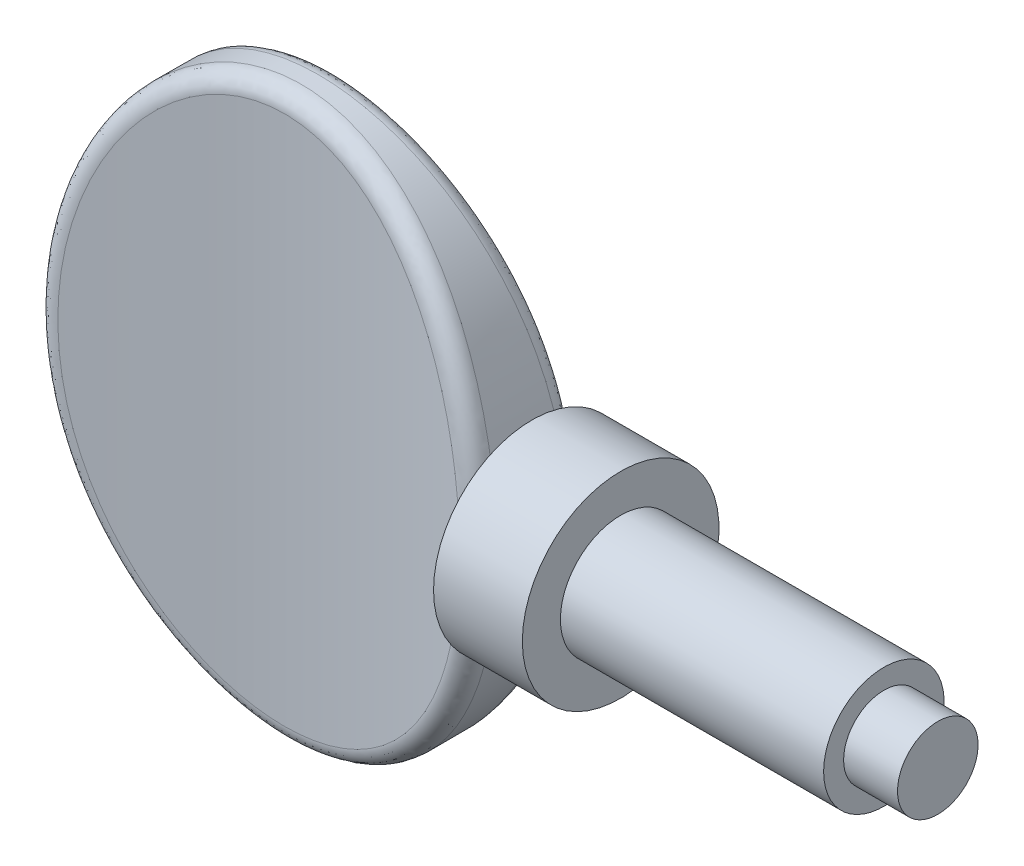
ISO-10303-21;
HEADER;
FILE_DESCRIPTION(('STEP AP214'),'2;1');
FILE_NAME('part.step','',(''),(''),'','','');
FILE_SCHEMA(('AUTOMOTIVE_DESIGN { 1 0 10303 214 1 1 1 1 }'));
ENDSEC;
DATA;
#1=APPLICATION_CONTEXT('core data for automotive mechanical design processes');
#2=APPLICATION_PROTOCOL_DEFINITION('international standard','automotive_design',2000,#1);
#3=PRODUCT_CONTEXT('',#1,'mechanical');
#4=PRODUCT('Part','Part','',(#3));
#5=PRODUCT_RELATED_PRODUCT_CATEGORY('part','',(#4));
#6=PRODUCT_DEFINITION_FORMATION('','',#4);
#7=PRODUCT_DEFINITION_CONTEXT('part definition',#1,'design');
#8=PRODUCT_DEFINITION('design','',#6,#7);
#9=PRODUCT_DEFINITION_SHAPE('','',#8);
#10=(LENGTH_UNIT() NAMED_UNIT(*) SI_UNIT(.MILLI.,.METRE.));
#11=(NAMED_UNIT(*) PLANE_ANGLE_UNIT() SI_UNIT($,.RADIAN.));
#12=(NAMED_UNIT(*) SI_UNIT($,.STERADIAN.) SOLID_ANGLE_UNIT());
#13=UNCERTAINTY_MEASURE_WITH_UNIT(LENGTH_MEASURE(1.E-05),#10,'distance_accuracy_value','');
#14=(GEOMETRIC_REPRESENTATION_CONTEXT(3) GLOBAL_UNCERTAINTY_ASSIGNED_CONTEXT((#13)) GLOBAL_UNIT_ASSIGNED_CONTEXT((#10,
#11,#12)) REPRESENTATION_CONTEXT('',''));
#15=CARTESIAN_POINT('',(0.,0.,0.));
#16=DIRECTION('',(0.,0.,1.));
#17=DIRECTION('',(1.,0.,0.));
#18=AXIS2_PLACEMENT_3D('',#15,#16,#17);
#19=CARTESIAN_POINT('',(0.,0.,2.286));
#20=DIRECTION('',(0.,0.,1.));
#21=DIRECTION('',(0.,1.,0.));
#22=AXIS2_PLACEMENT_3D('',#19,#20,#21);
#23=ELLIPSE('',#22,11.303,8.89);
#24=DIRECTION('',(0.,0.,-1.));
#25=VECTOR('',#24,1.);
#26=SURFACE_OF_LINEAR_EXTRUSION('',#23,#25);
#27=CARTESIAN_POINT('',(8.65241868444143,-2.59563035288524,1.41565744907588));
#28=CARTESIAN_POINT('',(8.64505380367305,-2.63527789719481,1.31316697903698));
#29=CARTESIAN_POINT('',(8.63830595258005,-2.67071705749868,1.20899028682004));
#30=CARTESIAN_POINT('',(8.62627848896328,-2.732857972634,0.997954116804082));
#31=CARTESIAN_POINT('',(8.6209992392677,-2.75955756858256,0.891093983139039));
#32=CARTESIAN_POINT('',(8.61214578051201,-2.8038850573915,0.675401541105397));
#33=CARTESIAN_POINT('',(8.60857205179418,-2.82151039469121,0.566568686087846));
#34=CARTESIAN_POINT('',(8.60328452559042,-2.84746342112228,0.347770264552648));
#35=CARTESIAN_POINT('',(8.60157044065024,-2.85579254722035,0.23780487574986));
#36=CARTESIAN_POINT('',(8.60008413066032,-2.86301911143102,0.018538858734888));
#37=CARTESIAN_POINT('',(8.60029463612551,-2.86200042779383,-0.0907588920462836));
#38=CARTESIAN_POINT('',(8.60260692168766,-2.8507444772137,-0.308858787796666));
#39=CARTESIAN_POINT('',(8.60470870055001,-2.8405072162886,-0.417660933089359));
#40=CARTESIAN_POINT('',(8.61070632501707,-2.810972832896,-0.633744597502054));
#41=CARTESIAN_POINT('',(8.61459849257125,-2.79169428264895,-0.741028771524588));
#42=CARTESIAN_POINT('',(8.62400975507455,-2.74432029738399,-0.953510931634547));
#43=CARTESIAN_POINT('',(8.62952797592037,-2.71622959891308,-1.05871000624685));
#44=CARTESIAN_POINT('',(8.63844994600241,-2.66982167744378,-1.20771767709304));
#45=CARTESIAN_POINT('',(8.64128872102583,-2.65493954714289,-1.25265626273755));
#46=CARTESIAN_POINT('',(8.64720516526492,-2.62361466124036,-1.34191094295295));
#47=CARTESIAN_POINT('',(8.65028255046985,-2.60717375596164,-1.3862277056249));
#48=CARTESIAN_POINT('',(8.65346985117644,-2.58995946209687,-1.43023949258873));
#49=B_SPLINE_CURVE_WITH_KNOTS('',3,(#27,#28,#29,#30,#31,#32,#33,#34,#35,#36,#37,#38,#39,#40,#41,
#42,#43,#44,#45,#46,#47,#48),.UNSPECIFIED.,.F.,.F.,(4,2,2,2,2,2,2,2,2,2,4),(0.,
0.330340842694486,0.660763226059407,0.991278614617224,1.3217429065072,1.64924484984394,
1.97674657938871,2.30357849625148,2.63023504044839,2.772481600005,2.91456137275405),.UNSPECIFIED.);
#50=CARTESIAN_POINT('',(8.64686129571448,-2.62539678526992,1.33619092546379));
#51=VERTEX_POINT('',#50);
#52=CARTESIAN_POINT('',(8.64686129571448,-2.62539678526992,-1.33619092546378));
#53=VERTEX_POINT('',#52);
#54=EDGE_CURVE('E101',#51,#53,#49,.T.);
#55=ORIENTED_EDGE('',*,*,#54,.F.);
#56=CARTESIAN_POINT('',(7.82629564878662,2.4351042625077,1.99569619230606));
#57=CARTESIAN_POINT('',(8.65245132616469,2.59576258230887,2.20582536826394));
#58=CARTESIAN_POINT('',(8.65956685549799,2.55680519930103,1.33926304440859));
#59=CARTESIAN_POINT('',(7.94743912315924,1.75770532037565,2.02649942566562));
#60=CARTESIAN_POINT('',(8.78692406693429,1.87112905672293,2.24349586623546));
#61=CARTESIAN_POINT('',(8.78960914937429,1.8448432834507,1.37072341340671));
#62=CARTESIAN_POINT('',(8.01716971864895,1.07004055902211,2.0448717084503));
#63=CARTESIAN_POINT('',(8.86351312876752,1.1404733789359,2.26573738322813));
#64=CARTESIAN_POINT('',(8.86432478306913,1.12299912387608,1.38948763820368));
#65=CARTESIAN_POINT('',(8.0547289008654,-0.309351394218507,2.05469325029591));
#66=CARTESIAN_POINT('',(8.90506846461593,-0.330332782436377,2.27771295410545));
#67=CARTESIAN_POINT('',(8.90458477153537,-0.324674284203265,1.399518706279));
#68=CARTESIAN_POINT('',(8.02243825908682,-1.00108239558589,2.04611100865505));
#69=CARTESIAN_POINT('',(8.86961883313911,-1.06541121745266,2.26732632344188));
#70=CARTESIAN_POINT('',(8.87000139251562,-1.05050720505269,1.39075337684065));
#71=CARTESIAN_POINT('',(7.89401839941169,-2.05341820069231,2.01297572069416));
#72=CARTESIAN_POINT('',(8.7273712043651,-2.18848798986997,2.22688533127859));
#73=CARTESIAN_POINT('',(8.7322517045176,-2.15566998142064,1.35691120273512));
#74=CARTESIAN_POINT('',(7.83428558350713,-2.41932216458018,1.99763575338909));
#75=CARTESIAN_POINT('',(8.66147254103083,-2.57804176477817,2.20823888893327));
#76=CARTESIAN_POINT('',(8.66816384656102,-2.54012241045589,1.34124398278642));
#77=CARTESIAN_POINT('',(7.68487396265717,-3.14447608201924,1.95997275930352));
#78=CARTESIAN_POINT('',(8.49634767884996,-3.35051128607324,2.16238668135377));
#79=CARTESIAN_POINT('',(8.50770464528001,-3.302633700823,1.30277751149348));
#80=CARTESIAN_POINT('',(7.59519051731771,-3.50372499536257,1.93764865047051));
#81=CARTESIAN_POINT('',(8.39743269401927,-3.73273694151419,2.13526405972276));
#82=CARTESIAN_POINT('',(8.41132829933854,-3.68069156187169,1.27997715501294));
#83=CARTESIAN_POINT('',(7.38556781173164,-4.21216799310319,1.88675959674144));
#84=CARTESIAN_POINT('',(8.16589203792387,-4.48682518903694,2.07336294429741));
#85=CARTESIAN_POINT('',(8.18576943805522,-4.42707064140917,1.22800246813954));
#86=CARTESIAN_POINT('',(7.26565071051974,-4.56136923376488,1.8581992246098));
#87=CARTESIAN_POINT('',(8.0337174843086,-4.85809981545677,2.03869510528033));
#88=CARTESIAN_POINT('',(8.05661094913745,-4.79539877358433,1.19883280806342));
#89=CARTESIAN_POINT('',(6.995124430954,-5.2464697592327,1.79585403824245));
#90=CARTESIAN_POINT('',(7.73510821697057,-5.5867008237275,1.96294144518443));
#91=CARTESIAN_POINT('',(7.76473855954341,-5.51911593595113,1.13515759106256));
#92=CARTESIAN_POINT('',(6.84452615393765,-5.58237371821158,1.76207108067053));
#93=CARTESIAN_POINT('',(7.56920233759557,-5.94356882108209,1.92197039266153));
#94=CARTESIAN_POINT('',(7.60203657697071,-5.87450950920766,1.10065393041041));
#95=CARTESIAN_POINT('',(6.43324199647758,-6.39240336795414,1.67357133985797));
#96=CARTESIAN_POINT('',(7.1165122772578,-6.80243787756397,1.81477728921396));
#97=CARTESIAN_POINT('',(7.15675137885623,-6.73320066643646,1.01026619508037));
#98=CARTESIAN_POINT('',(6.15417610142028,-6.85676635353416,1.61651047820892));
#99=CARTESIAN_POINT('',(6.80972916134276,-7.29531731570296,1.74570436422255));
#100=CARTESIAN_POINT('',(6.85386362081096,-7.22695535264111,0.951988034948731));
#101=CARTESIAN_POINT('',(5.52696453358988,-7.73305703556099,1.49913786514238));
#102=CARTESIAN_POINT('',(6.11796499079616,-8.22578037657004,1.60333969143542));
#103=CARTESIAN_POINT('',(6.17012522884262,-8.16227422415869,0.832111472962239));
#104=CARTESIAN_POINT('',(5.1789299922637,-8.14506735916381,1.43883145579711));
#105=CARTESIAN_POINT('',(5.73502064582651,-8.66343687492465,1.53025899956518));
#106=CARTESIAN_POINT('',(5.78939998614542,-8.60392057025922,0.770518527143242));
#107=CARTESIAN_POINT('',(4.49456535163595,-8.81832678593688,1.33426170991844));
#108=CARTESIAN_POINT('',(4.97849314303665,-9.37945459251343,1.4032069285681));
#109=CARTESIAN_POINT('',(5.0366311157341,-9.32899377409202,0.663717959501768));
#110=CARTESIAN_POINT('',(4.17119435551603,-9.09305461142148,1.28929359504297));
#111=CARTESIAN_POINT('',(4.62171828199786,-9.67163474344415,1.34859286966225));
#112=CARTESIAN_POINT('',(4.67963160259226,-9.62615608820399,0.617790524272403));
#113=CARTESIAN_POINT('',(3.65633336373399,-9.46244525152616,1.22675958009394));
#114=CARTESIAN_POINT('',(4.05119027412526,-10.0652330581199,1.27244557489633));
#115=CARTESIAN_POINT('',(4.10859190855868,-10.0272910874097,0.553922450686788));
#116=CARTESIAN_POINT('',(3.47966977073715,-9.5784960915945,1.2067276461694));
#117=CARTESIAN_POINT('',(3.85593810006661,-10.1886210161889,1.24810451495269));
#118=CARTESIAN_POINT('',(3.91223716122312,-10.1536091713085,0.533463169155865));
#119=CARTESIAN_POINT('',(3.11708209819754,-9.79472651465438,1.16885648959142));
#120=CARTESIAN_POINT('',(3.45504248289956,-10.4184405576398,1.20209344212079));
#121=CARTESIAN_POINT('',(3.50833839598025,-10.3894449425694,0.494784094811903));
#122=CARTESIAN_POINT('',(2.93116240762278,-9.89491352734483,1.15101624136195));
#123=CARTESIAN_POINT('',(3.2493632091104,-10.5250344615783,1.18039540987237));
#124=CARTESIAN_POINT('',(3.30079967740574,-10.4989704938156,0.476563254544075));
#125=CARTESIAN_POINT('',(2.54905941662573,-10.0787208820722,1.11790469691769));
#126=CARTESIAN_POINT('',(2.82653251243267,-10.7204996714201,1.14013561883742));
#127=CARTESIAN_POINT('',(2.87336447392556,-10.7002891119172,0.442745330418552));
#128=CARTESIAN_POINT('',(2.35279103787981,-10.162162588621,1.10266133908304));
#129=CARTESIAN_POINT('',(2.60916890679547,-10.8093536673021,1.12157484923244));
#130=CARTESIAN_POINT('',(2.65336386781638,-10.7918907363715,0.427176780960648));
#131=CARTESIAN_POINT('',(1.95321853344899,-10.3095327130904,1.0755046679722));
#132=CARTESIAN_POINT('',(2.16659574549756,-10.9661742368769,1.08852563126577));
#133=CARTESIAN_POINT('',(2.20463537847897,-10.9539332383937,0.399440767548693));
#134=CARTESIAN_POINT('',(1.74991833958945,-10.3734718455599,1.06358952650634));
#135=CARTESIAN_POINT('',(1.94121514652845,-11.0343149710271,1.07400206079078));
#136=CARTESIAN_POINT('',(1.97591236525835,-11.0243857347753,0.387271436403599));
#137=CARTESIAN_POINT('',(1.33807057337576,-10.4804542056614,1.04353897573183));
#138=CARTESIAN_POINT('',(1.48468245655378,-11.1482227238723,1.04958182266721));
#139=CARTESIAN_POINT('',(1.51188091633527,-11.1424052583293,0.366793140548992));
#140=CARTESIAN_POINT('',(1.12952697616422,-10.5235127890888,1.03540078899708));
#141=CARTESIAN_POINT('',(1.2532927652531,-11.1941423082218,1.03965311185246));
#142=CARTESIAN_POINT('',(1.27657745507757,-11.1899891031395,0.358481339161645));
#143=CARTESIAN_POINT('',(0.709126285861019,-10.5877622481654,1.02322405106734));
#144=CARTESIAN_POINT('',(0.787001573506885,-11.2625799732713,1.02481403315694));
#145=CARTESIAN_POINT('',(0.8017907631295,-11.2610341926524,0.346044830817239));
#146=CARTESIAN_POINT('',(0.49726981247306,-10.6089571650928,1.01918474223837));
#147=CARTESIAN_POINT('',(0.55180519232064,-11.2851925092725,1.0198833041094));
#148=CARTESIAN_POINT('',(0.562308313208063,-11.2844998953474,0.341919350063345));
#149=CARTESIAN_POINT('',(0.105050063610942,-10.627432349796,1.01566371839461));
#150=CARTESIAN_POINT('',(0.116614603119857,-11.3048795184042,1.01559044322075));
#151=CARTESIAN_POINT('',(0.118812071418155,-11.304954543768,0.338323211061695));
#152=CARTESIAN_POINT('',(-0.0751715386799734,-10.6278758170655,1.01557916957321));
#153=CARTESIAN_POINT('',(-0.0834564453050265,-11.3053519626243,1.01548738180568));
#154=CARTESIAN_POINT('',(-0.0850214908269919,-11.3054455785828,0.338236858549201));
#155=CARTESIAN_POINT('',(-0.434937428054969,-10.6127090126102,1.01846977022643));
#156=CARTESIAN_POINT('',(-0.482622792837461,-11.2891920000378,1.01901126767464));
#157=CARTESIAN_POINT('',(-0.491831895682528,-11.2886536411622,0.341189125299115));
#158=CARTESIAN_POINT('',(-0.614481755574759,-10.5970997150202,1.02144473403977));
#159=CARTESIAN_POINT('',(-0.681915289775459,-11.2725446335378,1.0226414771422));
#160=CARTESIAN_POINT('',(-0.694808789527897,-11.2713717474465,0.34422755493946));
#161=CARTESIAN_POINT('',(-0.971475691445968,-10.5501136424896,1.03036356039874));
#162=CARTESIAN_POINT('',(-1.0779135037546,-11.2224918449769,1.03351143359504));
#163=CARTESIAN_POINT('',(-1.0981231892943,-11.2193981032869,0.353336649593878));
#164=CARTESIAN_POINT('',(-1.14892554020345,-10.5187386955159,1.03630707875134));
#165=CARTESIAN_POINT('',(-1.27480360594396,-11.1890405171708,1.04076111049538));
#166=CARTESIAN_POINT('',(-1.29846099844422,-11.1847083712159,0.359406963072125));
#167=CARTESIAN_POINT('',(-1.50046734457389,-10.4407724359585,1.05098693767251));
#168=CARTESIAN_POINT('',(-1.66458038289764,-11.1060123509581,1.05864455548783));
#169=CARTESIAN_POINT('',(-1.69492269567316,-11.0986163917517,0.374399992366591));
#170=CARTESIAN_POINT('',(-1.6745592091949,-10.3941807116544,1.05972335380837));
#171=CARTESIAN_POINT('',(-1.85762658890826,-11.056361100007,1.06929413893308));
#172=CARTESIAN_POINT('',(-1.89104646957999,-11.047213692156,0.383322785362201));
#173=CARTESIAN_POINT('',(-2.01159554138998,-10.2886238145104,1.07935663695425));
#174=CARTESIAN_POINT('',(-2.23106714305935,-10.9440082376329,1.09319591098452));
#175=CARTESIAN_POINT('',(-2.27021161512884,-10.9309431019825,0.403374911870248));
#176=CARTESIAN_POINT('',(-2.17471076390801,-10.2302066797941,1.0901569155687));
#177=CARTESIAN_POINT('',(-2.4117997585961,-10.8817955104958,1.10635018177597));
#178=CARTESIAN_POINT('',(-2.45346562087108,-10.8666726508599,0.414405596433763));
#179=CARTESIAN_POINT('',(-2.4959633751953,-10.1008201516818,1.11384924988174));
#180=CARTESIAN_POINT('',(-2.76753136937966,-10.744137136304,1.13517612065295));
#181=CARTESIAN_POINT('',(-2.81382794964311,-10.7245661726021,0.438603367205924));
#182=CARTESIAN_POINT('',(-2.6540991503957,-10.0298467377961,1.12674197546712));
#183=CARTESIAN_POINT('',(-2.94261127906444,-10.6685976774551,1.15086640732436));
#184=CARTESIAN_POINT('',(-2.99093428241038,-10.6467258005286,0.451771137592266));
#185=CARTESIAN_POINT('',(-3.11989632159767,-9.79942559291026,1.16812424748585));
#186=CARTESIAN_POINT('',(-3.45909560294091,-10.4230523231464,1.20128501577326));
#187=CARTESIAN_POINT('',(-3.51173172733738,-10.394478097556,0.494036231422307));
#188=CARTESIAN_POINT('',(-3.41911154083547,-9.62242439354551,1.19932790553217));
#189=CARTESIAN_POINT('',(-3.79004687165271,-10.2345494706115,1.23926399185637));
#190=CARTESIAN_POINT('',(-3.84508579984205,-10.20128606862,0.52590556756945));
#191=CARTESIAN_POINT('',(-4.09904643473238,-9.15457953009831,1.27920788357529));
#192=CARTESIAN_POINT('',(-4.54276316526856,-9.7366002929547,1.33643019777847));
#193=CARTESIAN_POINT('',(-4.59999386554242,-9.69271674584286,0.607489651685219));
#194=CARTESIAN_POINT('',(-4.4677733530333,-8.84600074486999,1.33002831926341));
#195=CARTESIAN_POINT('',(-4.94952770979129,-9.40827652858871,1.39816929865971));
#196=CARTESIAN_POINT('',(-5.00720170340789,-9.35876546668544,0.659394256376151));
#197=CARTESIAN_POINT('',(-5.1506512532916,-8.17151649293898,1.43465606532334));
#198=CARTESIAN_POINT('',(-5.70311367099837,-8.69214633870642,1.52508390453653));
#199=CARTESIAN_POINT('',(-5.75825220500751,-8.63243872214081,0.766254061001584));
#200=CARTESIAN_POINT('',(-5.46469809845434,-7.80550411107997,1.48846882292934));
#201=CARTESIAN_POINT('',(-6.04883115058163,-8.30338280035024,1.59030661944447));
#202=CARTESIAN_POINT('',(-6.10197403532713,-8.23995436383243,0.821214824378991));
#203=CARTESIAN_POINT('',(-6.11532335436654,-6.92506403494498,1.6082879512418));
#204=CARTESIAN_POINT('',(-6.76780893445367,-7.36679603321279,1.7359003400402));
#205=CARTESIAN_POINT('',(-6.81177427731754,-7.29951289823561,0.943590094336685));
#206=CARTESIAN_POINT('',(-6.43476934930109,-6.39735552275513,1.67362664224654));
#207=CARTESIAN_POINT('',(-7.11866978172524,-6.80670608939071,1.81495566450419));
#208=CARTESIAN_POINT('',(-7.15847428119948,-6.73831516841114,1.01032267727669));
#209=CARTESIAN_POINT('',(-6.98586982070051,-5.29504721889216,1.79279155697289));
#210=CARTESIAN_POINT('',(-7.72672939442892,-5.63515267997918,1.95964859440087));
#211=CARTESIAN_POINT('',(-7.75498793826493,-5.57007516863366,1.13202977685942));
#212=CARTESIAN_POINT('',(-7.21743550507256,-4.72040071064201,1.84660611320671));
#213=CARTESIAN_POINT('',(-7.98107986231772,-5.02517153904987,2.02476167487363));
#214=CARTESIAN_POINT('',(-8.00470360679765,-4.96298727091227,1.18699237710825));
#215=CARTESIAN_POINT('',(-7.59788704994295,-3.53286241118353,1.93787390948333));
#216=CARTESIAN_POINT('',(-8.40127783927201,-3.76125290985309,2.13576419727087));
#217=CARTESIAN_POINT('',(-8.41432758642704,-3.71108875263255,1.28020721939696));
#218=CARTESIAN_POINT('',(-7.74551320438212,-2.91953395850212,1.97507615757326));
#219=CARTESIAN_POINT('',(-8.56353360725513,-3.10968614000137,2.18081781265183));
#220=CARTESIAN_POINT('',(-8.572867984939,-3.06585606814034,1.31820311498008));
#221=CARTESIAN_POINT('',(-7.95444111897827,-1.67779030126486,2.02838222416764));
#222=CARTESIAN_POINT('',(-8.79452477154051,-1.78651139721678,2.24575202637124));
#223=CARTESIAN_POINT('',(-8.79710310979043,-1.76097068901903,1.37264637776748));
#224=CARTESIAN_POINT('',(-8.01589074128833,-1.04940282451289,2.04452217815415));
#225=CARTESIAN_POINT('',(-8.86213168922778,-1.11847428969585,2.26532120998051));
#226=CARTESIAN_POINT('',(-8.86295686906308,-1.10134467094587,1.38913065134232));
#227=CARTESIAN_POINT('',(-8.04339962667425,-0.134428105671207,2.05173737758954));
#228=CARTESIAN_POINT('',(-8.89250870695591,-0.143244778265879,2.27410147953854));
#229=CARTESIAN_POINT('',(-8.89243947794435,-0.141070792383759,1.39649977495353));
#230=CARTESIAN_POINT('',(-8.04322422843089,0.151433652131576,2.05168672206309));
#231=CARTESIAN_POINT('',(-8.89232438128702,0.161377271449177,2.2740424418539));
#232=CARTESIAN_POINT('',(-8.8922524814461,0.158917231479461,1.39644803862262));
#233=CARTESIAN_POINT('',(-8.02535656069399,0.722706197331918,2.04701032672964));
#234=CARTESIAN_POINT('',(-8.87256700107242,0.770474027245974,2.26834414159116));
#235=CARTESIAN_POINT('',(-8.87310070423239,0.758474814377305,1.39167188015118));
#236=CARTESIAN_POINT('',(-8.00765727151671,1.00811675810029,2.04238275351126));
#237=CARTESIAN_POINT('',(-8.85300951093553,1.07458955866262,2.26270936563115));
#238=CARTESIAN_POINT('',(-8.85412839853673,1.05804415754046,1.3869455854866));
#239=CARTESIAN_POINT('',(-7.947886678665,1.6500558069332,2.02685880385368));
#240=CARTESIAN_POINT('',(-8.78692419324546,1.75875334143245,2.24379627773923));
#241=CARTESIAN_POINT('',(-8.79003704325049,1.73201243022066,1.37109045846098));
#242=CARTESIAN_POINT('',(-7.90073256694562,2.00606858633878,2.01465999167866));
#243=CARTESIAN_POINT('',(-8.73487578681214,2.1378622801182,2.22895949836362));
#244=CARTESIAN_POINT('',(-8.73946402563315,2.10591711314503,1.35863140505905));
#245=CARTESIAN_POINT('',(-7.77848949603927,2.71274841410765,1.98351195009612));
#246=CARTESIAN_POINT('',(-8.5997385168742,2.89083812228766,2.19102428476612));
#247=CARTESIAN_POINT('',(-8.6082550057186,2.84858479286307,1.3268188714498));
#248=CARTESIAN_POINT('',(-7.70339994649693,3.063415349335,1.9645625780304));
#249=CARTESIAN_POINT('',(-8.51689426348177,3.26405432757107,2.16799271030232));
#250=CARTESIAN_POINT('',(-8.52761836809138,3.21734768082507,1.30746524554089));
#251=CARTESIAN_POINT('',(-7.52482874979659,3.75734261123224,1.92045005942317));
#252=CARTESIAN_POINT('',(-8.3196020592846,4.00293869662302,2.11431336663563));
#253=CARTESIAN_POINT('',(-8.33564394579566,3.94777946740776,1.26241165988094));
#254=CARTESIAN_POINT('',(-7.42130346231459,4.10059067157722,1.89527736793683));
#255=CARTESIAN_POINT('',(-8.20545267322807,4.36801638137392,2.0837427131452));
#256=CARTESIAN_POINT('',(-8.22425897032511,4.30943653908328,1.23670195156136));
#257=CARTESIAN_POINT('',(-7.18557888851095,4.77601163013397,1.83956259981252));
#258=CARTESIAN_POINT('',(-7.94517850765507,5.08660176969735,2.01601312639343));
#259=CARTESIAN_POINT('',(-7.97026371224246,5.02200340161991,1.17979860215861));
#260=CARTESIAN_POINT('',(-7.05338947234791,5.10818829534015,1.80902237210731));
#261=CARTESIAN_POINT('',(-7.79950129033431,5.43963428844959,1.97895746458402));
#262=CARTESIAN_POINT('',(-7.8276641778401,5.37291684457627,1.14860684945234));
#263=CARTESIAN_POINT('',(-6.67495246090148,5.94632514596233,1.72466643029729));
#264=CARTESIAN_POINT('',(-7.38297359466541,6.32842399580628,1.8767643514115));
#265=CARTESIAN_POINT('',(-7.4186740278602,6.25981775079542,1.06245131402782));
#266=CARTESIAN_POINT('',(-6.40690462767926,6.44195824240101,1.66758899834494));
#267=CARTESIAN_POINT('',(-7.08838989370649,6.8544708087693,1.80768456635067));
#268=CARTESIAN_POINT('',(-7.12833321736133,6.78575428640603,1.00415623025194));
#269=CARTESIAN_POINT('',(-5.79654461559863,7.38178409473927,1.54807423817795));
#270=CARTESIAN_POINT('',(-6.41517877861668,7.85259495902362,1.66268974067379));
#271=CARTESIAN_POINT('',(-6.46441231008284,7.78670698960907,0.882091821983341));
#272=CARTESIAN_POINT('',(-5.45436166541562,7.82606432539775,1.48564634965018));
#273=CARTESIAN_POINT('',(-6.03887887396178,8.32439730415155,1.58707563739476));
#274=CARTESIAN_POINT('',(-6.09097702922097,8.26180964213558,0.81833213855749));
#275=CARTESIAN_POINT('',(-4.77789167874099,8.55448470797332,1.37612062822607));
#276=CARTESIAN_POINT('',(-5.29119543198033,9.09910698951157,1.45400801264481));
#277=CARTESIAN_POINT('',(-5.34869298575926,9.04439141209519,0.70646986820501));
#278=CARTESIAN_POINT('',(-4.45799420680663,8.85245688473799,1.32863499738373));
#279=CARTESIAN_POINT('',(-4.93851328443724,9.41585809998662,1.39637707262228));
#280=CARTESIAN_POINT('',(-4.99642235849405,9.36587548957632,0.65797121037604));
#281=CARTESIAN_POINT('',(-3.77461012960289,9.39190551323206,1.23929408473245));
#282=CARTESIAN_POINT('',(-4.18378611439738,9.98880971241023,1.2879446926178));
#283=CARTESIAN_POINT('',(-4.24030383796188,9.95027102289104,0.566724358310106));
#284=CARTESIAN_POINT('',(-3.41117328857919,9.63344555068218,1.19743248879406));
#285=CARTESIAN_POINT('',(-3.78213052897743,10.2460992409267,1.237002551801));
#286=CARTESIAN_POINT('',(-3.83651479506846,10.2132483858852,0.523969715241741));
#287=CARTESIAN_POINT('',(-2.7071131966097,10.0130852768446,1.12997552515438));
#288=CARTESIAN_POINT('',(-3.00265612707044,10.6500345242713,1.15495053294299));
#289=CARTESIAN_POINT('',(-3.05059237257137,10.6281650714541,0.455073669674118));
#290=CARTESIAN_POINT('',(-2.37204630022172,10.1615243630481,1.10285226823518));
#291=CARTESIAN_POINT('',(-2.63139042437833,10.8083853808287,1.12186903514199));
#292=CARTESIAN_POINT('',(-2.67521894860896,10.7911098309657,0.427371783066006));
#293=CARTESIAN_POINT('',(-1.85473120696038,10.3404490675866,1.06974582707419));
#294=CARTESIAN_POINT('',(-2.05733540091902,10.9991414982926,1.08150227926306));
#295=CARTESIAN_POINT('',(-2.09383679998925,10.9879949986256,0.393559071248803));
#296=CARTESIAN_POINT('',(-1.67979337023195,10.3928095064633,1.05997187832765));
#297=CARTESIAN_POINT('',(-1.86339026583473,11.0549303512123,1.06959065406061));
#298=CARTESIAN_POINT('',(-1.89693593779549,11.045710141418,0.383576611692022));
#299=CARTESIAN_POINT('',(-1.32608818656,10.4821521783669,1.04321230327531));
#300=CARTESIAN_POINT('',(-1.47128411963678,11.1500600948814,1.04917741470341));
#301=CARTESIAN_POINT('',(-1.49833774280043,11.1442889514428,0.366459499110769));
#302=CARTESIAN_POINT('',(-1.14732240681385,10.5191405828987,1.03622555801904));
#303=CARTESIAN_POINT('',(-1.27297000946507,11.1894916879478,1.04065670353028));
#304=CARTESIAN_POINT('',(-1.29664236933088,11.1851593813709,0.359323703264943));
#305=CARTESIAN_POINT('',(-0.786475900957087,10.5772111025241,1.02522674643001));
#306=CARTESIAN_POINT('',(-0.872750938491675,11.2513466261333,1.0272534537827));
#307=CARTESIAN_POINT('',(-0.8891721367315,11.2493631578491,0.348090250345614));
#308=CARTESIAN_POINT('',(-0.604384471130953,10.5982263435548,1.02122718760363));
#309=CARTESIAN_POINT('',(-0.670646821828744,11.2737587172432,1.02237324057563));
#310=CARTESIAN_POINT('',(-0.683383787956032,11.2726227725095,0.344005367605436));
#311=CARTESIAN_POINT('',(-0.239046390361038,10.6237097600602,1.01637444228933));
#312=CARTESIAN_POINT('',(-0.265317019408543,11.3009091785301,1.01645776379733));
#313=CARTESIAN_POINT('',(-0.270347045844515,11.3008314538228,0.339049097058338));
#314=CARTESIAN_POINT('',(-0.0557997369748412,10.6281779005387,1.01552126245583));
#315=CARTESIAN_POINT('',(-0.0618866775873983,11.3056751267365,1.01541649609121));
#316=CARTESIAN_POINT('',(-0.0630986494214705,11.3057804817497,0.338177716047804));
#317=CARTESIAN_POINT('',(0.310342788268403,10.6204795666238,1.01698891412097));
#318=CARTESIAN_POINT('',(0.344362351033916,11.2974728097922,1.01720566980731));
#319=CARTESIAN_POINT('',(0.350954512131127,11.2972566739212,0.339676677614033));
#320=CARTESIAN_POINT('',(0.493238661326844,10.6083131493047,1.0193097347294));
#321=CARTESIAN_POINT('',(0.547389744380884,11.2844961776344,1.02003793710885));
#322=CARTESIAN_POINT('',(0.557759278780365,11.2837839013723,0.342047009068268));
#323=CARTESIAN_POINT('',(0.857193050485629,10.5675786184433,1.02705146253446));
#324=CARTESIAN_POINT('',(0.951137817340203,11.2411005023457,1.02947400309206));
#325=CARTESIAN_POINT('',(0.969049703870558,11.2387130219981,0.349953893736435));
#326=CARTESIAN_POINT('',(1.03825162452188,10.5390110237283,1.03247227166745));
#327=CARTESIAN_POINT('',(1.15205642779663,11.2106386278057,1.03608708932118));
#328=CARTESIAN_POINT('',(1.17353543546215,11.2071154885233,0.355490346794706));
#329=CARTESIAN_POINT('',(1.38577241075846,10.4683102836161,1.04581044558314));
#330=CARTESIAN_POINT('',(1.53738746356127,11.1353476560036,1.05233647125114));
#331=CARTESIAN_POINT('',(1.56562555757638,11.1290138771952,0.36911306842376));
#332=CARTESIAN_POINT('',(1.55243251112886,10.4271514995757,1.05354783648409));
#333=CARTESIAN_POINT('',(1.72221209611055,11.0914846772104,1.06176887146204));
#334=CARTESIAN_POINT('',(1.75347855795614,11.0835813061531,0.377015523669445));
#335=CARTESIAN_POINT('',(1.88194456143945,10.3315323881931,1.07139376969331));
#336=CARTESIAN_POINT('',(2.08740434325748,10.9896901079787,1.08349994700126));
#337=CARTESIAN_POINT('',(2.12443081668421,10.9781855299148,0.395242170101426));
#338=CARTESIAN_POINT('',(2.0447952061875,10.2770675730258,1.08150311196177));
#339=CARTESIAN_POINT('',(2.26788778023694,10.9316775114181,1.09581547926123));
#340=CARTESIAN_POINT('',(2.30752844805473,10.9182174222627,0.405567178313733));
#341=CARTESIAN_POINT('',(2.52615676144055,10.0948432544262,1.11502540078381));
#342=CARTESIAN_POINT('',(2.80192013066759,10.7374389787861,1.13667911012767));
#343=CARTESIAN_POINT('',(2.84792805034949,10.7179160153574,0.439804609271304));
#344=CARTESIAN_POINT('',(2.83775186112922,9.94819639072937,1.14164376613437));
#345=CARTESIAN_POINT('',(3.14702031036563,10.5810992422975,1.16912176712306));
#346=CARTESIAN_POINT('',(3.19664674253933,10.5571217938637,0.466990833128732));
#347=CARTESIAN_POINT('',(3.46147687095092,9.59774159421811,1.20356654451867));
#348=CARTESIAN_POINT('',(3.83708974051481,10.2084377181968,1.24439518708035));
#349=CARTESIAN_POINT('',(3.89231625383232,10.1744153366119,0.530234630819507));
#350=CARTESIAN_POINT('',(3.77151791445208,9.3902081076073,1.23940741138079));
#351=CARTESIAN_POINT('',(4.17970555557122,9.98753738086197,1.28798248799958));
#352=CARTESIAN_POINT('',(4.23673354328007,9.94854700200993,0.56684010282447));
#353=CARTESIAN_POINT('',(4.35991988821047,8.93336469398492,1.3153767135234));
#354=CARTESIAN_POINT('',(4.82954880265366,9.50230750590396,1.38018944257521));
#355=CARTESIAN_POINT('',(4.88803612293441,9.45342711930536,0.644430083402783));
#356=CARTESIAN_POINT('',(4.63825599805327,8.68402240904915,1.3555084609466));
#357=CARTESIAN_POINT('',(5.1365679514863,9.23728381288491,1.42890183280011));
#358=CARTESIAN_POINT('',(5.19489202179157,9.18414197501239,0.685417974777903));
#359=CARTESIAN_POINT('',(5.2883525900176,8.02265329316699,1.45704370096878));
#360=CARTESIAN_POINT('',(5.8558547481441,8.53323619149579,1.55237909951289));
#361=CARTESIAN_POINT('',(5.90931964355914,8.47252416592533,0.789119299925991));
#362=CARTESIAN_POINT('',(5.64019381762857,7.59026791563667,1.51934813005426));
#363=CARTESIAN_POINT('',(6.24288672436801,8.07397250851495,1.62786734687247));
#364=CARTESIAN_POINT('',(6.29382777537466,8.00948569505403,0.852752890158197));
#365=CARTESIAN_POINT('',(6.27033111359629,6.67225546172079,1.63966575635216));
#366=CARTESIAN_POINT('',(6.93790446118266,7.09909556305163,1.77382186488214));
#367=CARTESIAN_POINT('',(6.98009678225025,7.03057005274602,0.975637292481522));
#368=CARTESIAN_POINT('',(6.54850581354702,6.18654236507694,1.69767175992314));
#369=CARTESIAN_POINT('',(7.2436171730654,6.58356877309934,1.84402554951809));
#370=CARTESIAN_POINT('',(7.28172113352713,6.51460760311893,1.03488075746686));
#371=CARTESIAN_POINT('',(7.03636802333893,5.17052156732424,1.80448690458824));
#372=CARTESIAN_POINT('',(7.7819565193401,5.50356359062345,1.97373871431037));
#373=CARTESIAN_POINT('',(7.80945284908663,5.43850602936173,1.14397462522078));
#374=CARTESIAN_POINT('',(7.24495455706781,4.63964991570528,1.85314346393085));
#375=CARTESIAN_POINT('',(8.01126147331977,4.93984669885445,2.03265655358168));
#376=CARTESIAN_POINT('',(8.03434739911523,4.87781622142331,1.19366919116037));
#377=CARTESIAN_POINT('',(7.5896007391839,3.55324278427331,1.93595435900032));
#378=CARTESIAN_POINT('',(8.39188677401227,3.78362130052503,2.13336693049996));
#379=CARTESIAN_POINT('',(8.40539047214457,3.7326204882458,1.27824671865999));
#380=CARTESIAN_POINT('',(7.72568060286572,2.99771422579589,1.97011273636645));
#381=CARTESIAN_POINT('',(8.54157946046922,3.19321802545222,2.17476629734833));
#382=CARTESIAN_POINT('',(8.55156094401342,3.14812125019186,1.31313380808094));
#383=CARTESIAN_POINT('',(7.82629564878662,2.4351042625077,1.99569619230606));
#384=CARTESIAN_POINT('',(8.65245132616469,2.59576258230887,2.20582536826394));
#385=CARTESIAN_POINT('',(8.65956685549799,2.55680519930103,1.33926304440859));
#386=(BOUNDED_SURFACE() B_SPLINE_SURFACE(3,2,((#56,#57,#58),(#59,#60,#61),(#62,#63,#64),(#65,
#66,#67),(#68,#69,#70),(#71,#72,#73),(#74,#75,#76),(#77,#78,#79),(#80,#81,#82),(#83,#84,#85),
(#86,#87,#88),(#89,#90,#91),(#92,#93,#94),(#95,#96,#97),(#98,#99,#100),(#101,#102,#103),(#104,
#105,#106),(#107,#108,#109),(#110,#111,#112),(#113,#114,#115),(#116,#117,#118),(#119,#120,#121),
(#122,#123,#124),(#125,#126,#127),(#128,#129,#130),(#131,#132,#133),(#134,#135,#136),(#137,#138,
#139),(#140,#141,#142),(#143,#144,#145),(#146,#147,#148),(#149,#150,#151),(#152,#153,#154),
(#155,#156,#157),(#158,#159,#160),(#161,#162,#163),(#164,#165,#166),(#167,#168,#169),(#170,#171,
#172),(#173,#174,#175),(#176,#177,#178),(#179,#180,#181),(#182,#183,#184),(#185,#186,#187),
(#188,#189,#190),(#191,#192,#193),(#194,#195,#196),(#197,#198,#199),(#200,#201,#202),(#203,#204,
#205),(#206,#207,#208),(#209,#210,#211),(#212,#213,#214),(#215,#216,#217),(#218,#219,#220),
(#221,#222,#223),(#224,#225,#226),(#227,#228,#229),(#230,#231,#232),(#233,#234,#235),(#236,#237,
#238),(#239,#240,#241),(#242,#243,#244),(#245,#246,#247),(#248,#249,#250),(#251,#252,#253),
(#254,#255,#256),(#257,#258,#259),(#260,#261,#262),(#263,#264,#265),(#266,#267,#268),(#269,#270,
#271),(#272,#273,#274),(#275,#276,#277),(#278,#279,#280),(#281,#282,#283),(#284,#285,#286),
(#287,#288,#289),(#290,#291,#292),(#293,#294,#295),(#296,#297,#298),(#299,#300,#301),(#302,#303,
#304),(#305,#306,#307),(#308,#309,#310),(#311,#312,#313),(#314,#315,#316),(#317,#318,#319),
(#320,#321,#322),(#323,#324,#325),(#326,#327,#328),(#329,#330,#331),(#332,#333,#334),(#335,#336,
#337),(#338,#339,#340),(#341,#342,#343),(#344,#345,#346),(#347,#348,#349),(#350,#351,#352),
(#353,#354,#355),(#356,#357,#358),(#359,#360,#361),(#362,#363,#364),(#365,#366,#367),(#368,#369,
#370),(#371,#372,#373),(#374,#375,#376),(#377,#378,#379),(#380,#381,#382),(#383,#384,#385)),
.UNSPECIFIED.,.T.,.F.,.F.) B_SPLINE_SURFACE_WITH_KNOTS((4,2,2,2,2,2,2,2,2,2,2,2,2,2,2,2,2,2,2,2,
2,2,2,2,2,2,2,2,2,2,2,2,2,2,2,2,2,2,2,2,2,2,2,2,2,2,2,2,2,2,2,2,2,2,4),(3,3),(0.,
2.06622314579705,4.13486190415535,5.24755247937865,6.36041552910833,7.4724652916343,
8.58412061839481,10.2215277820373,11.8563176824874,13.1469674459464,13.792803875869,
14.4383369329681,15.0904277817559,15.7421597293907,16.3934116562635,17.0445431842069,
17.5960362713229,18.1474958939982,18.6988915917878,19.2503022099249,19.7803937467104,
20.3106553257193,21.3706565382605,22.831692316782,24.295480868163,26.1576819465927,
28.0217595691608,29.9131198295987,31.8012308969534,32.6583453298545,33.5158032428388,
34.5929671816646,35.6701538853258,36.7490030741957,37.8274813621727,39.5282876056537,
41.226152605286,42.5557025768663,43.883747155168,45.0006946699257,45.5594567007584,
46.1179941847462,46.6788573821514,47.2397217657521,47.8005842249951,48.3614289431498,
48.8867331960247,49.4122148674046,50.4623283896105,51.5993275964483,52.737210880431,
54.4254075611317,56.116368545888,57.8329376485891,59.5490279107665),(0.,1.),
.UNSPECIFIED.) GEOMETRIC_REPRESENTATION_ITEM() RATIONAL_B_SPLINE_SURFACE(((1.,0.615432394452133,
1.),(1.,0.61297474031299,1.),(1.,0.611532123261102,1.),(1.,0.610758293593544,1.),(1.,
0.611429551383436,1.),(1.,0.61405591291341,1.),(1.,0.615274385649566,1.),(1.,0.618290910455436,
1.),(1.,0.62008905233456,1.),(1.,0.624233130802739,1.),(1.,0.626578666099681,1.),(1.,
0.631770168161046,1.),(1.,0.634615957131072,1.),(1.,0.642197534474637,1.),(1.,0.647190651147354,
1.),(1.,0.657791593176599,1.),(1.,0.663398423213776,1.),(1.,0.673468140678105,1.),(1.,
0.677923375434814,1.),(1.,0.684287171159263,1.),(1.,0.686356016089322,1.),(1.,0.690317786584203,
1.),(1.,0.692210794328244,1.),(1.,0.695765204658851,1.),(1.,0.697424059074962,1.),(1.,
0.700407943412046,1.),(1.,0.701733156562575,1.),(1.,0.703978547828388,1.),(1.,0.70489902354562,
1.),(1.,0.706281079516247,1.),(1.,0.706742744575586,1.),(1.,0.707145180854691,1.),(1.,
0.707154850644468,1.),(1.,0.706824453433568,1.),(1.,0.706484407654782,1.),(1.,0.705470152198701,
1.),(1.,0.704795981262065,1.),(1.,0.703143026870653,1.),(1.,0.702164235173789,1.),(1.,
0.699984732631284,1.),(1.,0.698794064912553,1.),(1.,0.696208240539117,1.),(1.,0.69481301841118,
1.),(1.,0.6903842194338,1.),(1.,0.6871063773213,1.),(1.,0.678923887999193,1.),(1.,
0.673872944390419,1.),(1.,0.66380350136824,1.),(1.,0.658785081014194,1.),(1.,0.647904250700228,
1.),(1.,0.642183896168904,1.),(1.,0.63199434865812,1.),(1.,0.627526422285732,1.),(1.,
0.620055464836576,1.),(1.,0.617074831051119,1.),(1.,0.612828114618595,1.),(1.,0.611559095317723,
1.),(1.,0.610991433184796,1.),(1.,0.610995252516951,1.),(1.,0.611363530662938,1.),(1.,
0.611728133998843,1.),(1.,0.612954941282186,1.),(1.,0.613920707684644,1.),(1.,0.616403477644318,
1.),(1.,0.617920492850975,1.),(1.,0.621485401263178,1.),(1.,0.623534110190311,1.),(1.,
0.62812384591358,1.),(1.,0.630664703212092,1.),(1.,0.637788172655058,1.),(1.,0.642702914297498,
1.),(1.,0.653321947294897,1.),(1.,0.659024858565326,1.),(1.,0.669395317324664,1.),(1.,
0.674019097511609,1.),(1.,0.68297001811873,1.),(1.,0.687297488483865,1.),(1.,0.694444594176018,
1.),(1.,0.697394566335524,1.),(1.,0.701047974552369,1.),(1.,0.702137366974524,1.),(1.,
0.70401629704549,1.),(1.,0.704805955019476,1.),(1.,0.706053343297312,1.),(1.,0.706509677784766,
1.),(1.,0.707063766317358,1.),(1.,0.707161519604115,1.),(1.,0.706993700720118,1.),(1.,
0.706728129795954,1.),(1.,0.705846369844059,1.),(1.,0.705230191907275,1.),(1.,0.703724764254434,
1.),(1.,0.702855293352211,1.),(1.,0.700866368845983,1.),(1.,0.699746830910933,1.),(1.,
0.696070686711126,1.),(1.,0.693195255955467,1.),(1.,0.686667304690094,1.),(1.,0.682970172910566,
1.),(1.,0.675337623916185,1.),(1.,0.671402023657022,1.),(1.,0.661686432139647,1.),(1.,
0.655934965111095,1.),(1.,0.645145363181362,1.),(1.,0.64010841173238,1.),(1.,0.631022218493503,
1.),(1.,0.626989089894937,1.),(1.,0.620214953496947,1.),(1.,0.617473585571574,1.),(1.,
0.615432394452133,1.))) REPRESENTATION_ITEM('') SURFACE());
#387=CARTESIAN_POINT('',(8.65956685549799,2.55680519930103,1.33926304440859));
#388=CARTESIAN_POINT('',(8.78960914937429,1.8448432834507,1.37072341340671));
#389=CARTESIAN_POINT('',(8.86432478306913,1.12299912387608,1.38948763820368));
#390=CARTESIAN_POINT('',(8.90458477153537,-0.324674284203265,1.399518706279));
#391=CARTESIAN_POINT('',(8.87000139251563,-1.05050720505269,1.39075337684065));
#392=CARTESIAN_POINT('',(8.7322517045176,-2.15566998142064,1.35691120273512));
#393=CARTESIAN_POINT('',(8.66816384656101,-2.54012241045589,1.34124398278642));
#394=CARTESIAN_POINT('',(8.50770464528,-3.302633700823,1.30277751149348));
#395=CARTESIAN_POINT('',(8.41132829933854,-3.68069156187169,1.27997715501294));
#396=CARTESIAN_POINT('',(8.18576943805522,-4.42707064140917,1.22800246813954));
#397=CARTESIAN_POINT('',(8.05661094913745,-4.79539877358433,1.19883280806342));
#398=CARTESIAN_POINT('',(7.76473855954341,-5.51911593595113,1.13515759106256));
#399=CARTESIAN_POINT('',(7.60203657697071,-5.87450950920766,1.10065393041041));
#400=CARTESIAN_POINT('',(7.15675137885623,-6.73320066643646,1.01026619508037));
#401=CARTESIAN_POINT('',(6.85386362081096,-7.22695535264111,0.951988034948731));
#402=CARTESIAN_POINT('',(6.17012522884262,-8.16227422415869,0.832111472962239));
#403=CARTESIAN_POINT('',(5.78939998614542,-8.60392057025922,0.770518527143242));
#404=CARTESIAN_POINT('',(5.0366311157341,-9.32899377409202,0.663717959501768));
#405=CARTESIAN_POINT('',(4.67963160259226,-9.62615608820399,0.617790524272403));
#406=CARTESIAN_POINT('',(4.10859190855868,-10.0272910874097,0.553922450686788));
#407=CARTESIAN_POINT('',(3.91223716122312,-10.1536091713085,0.533463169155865));
#408=CARTESIAN_POINT('',(3.50833839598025,-10.3894449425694,0.494784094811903));
#409=CARTESIAN_POINT('',(3.30079967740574,-10.4989704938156,0.476563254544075));
#410=CARTESIAN_POINT('',(2.87336447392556,-10.7002891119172,0.442745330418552));
#411=CARTESIAN_POINT('',(2.65336386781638,-10.7918907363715,0.427176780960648));
#412=CARTESIAN_POINT('',(2.20463537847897,-10.9539332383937,0.399440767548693));
#413=CARTESIAN_POINT('',(1.97591236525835,-11.0243857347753,0.387271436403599));
#414=CARTESIAN_POINT('',(1.51188091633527,-11.1424052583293,0.366793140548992));
#415=CARTESIAN_POINT('',(1.27657745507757,-11.1899891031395,0.358481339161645));
#416=CARTESIAN_POINT('',(0.801790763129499,-11.2610341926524,0.346044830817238));
#417=CARTESIAN_POINT('',(0.562308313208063,-11.2844998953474,0.341919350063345));
#418=CARTESIAN_POINT('',(0.118812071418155,-11.3049545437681,0.338323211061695));
#419=CARTESIAN_POINT('',(-0.0850214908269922,-11.3054455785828,0.338236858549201));
#420=CARTESIAN_POINT('',(-0.491831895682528,-11.2886536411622,0.341189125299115));
#421=CARTESIAN_POINT('',(-0.694808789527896,-11.2713717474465,0.344227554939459));
#422=CARTESIAN_POINT('',(-1.0981231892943,-11.2193981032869,0.353336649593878));
#423=CARTESIAN_POINT('',(-1.29846099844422,-11.1847083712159,0.359406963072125));
#424=CARTESIAN_POINT('',(-1.69492269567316,-11.0986163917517,0.374399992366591));
#425=CARTESIAN_POINT('',(-1.89104646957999,-11.047213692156,0.383322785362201));
#426=CARTESIAN_POINT('',(-2.27021161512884,-10.9309431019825,0.403374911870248));
#427=CARTESIAN_POINT('',(-2.45346562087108,-10.8666726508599,0.414405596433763));
#428=CARTESIAN_POINT('',(-2.81382794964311,-10.7245661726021,0.438603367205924));
#429=CARTESIAN_POINT('',(-2.99093428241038,-10.6467258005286,0.451771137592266));
#430=CARTESIAN_POINT('',(-3.51173172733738,-10.394478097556,0.494036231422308));
#431=CARTESIAN_POINT('',(-3.84508579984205,-10.20128606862,0.52590556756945));
#432=CARTESIAN_POINT('',(-4.59999386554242,-9.69271674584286,0.607489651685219));
#433=CARTESIAN_POINT('',(-5.00720170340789,-9.35876546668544,0.659394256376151));
#434=CARTESIAN_POINT('',(-5.75825220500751,-8.63243872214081,0.766254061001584));
#435=CARTESIAN_POINT('',(-6.10197403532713,-8.23995436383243,0.821214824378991));
#436=CARTESIAN_POINT('',(-6.81177427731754,-7.29951289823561,0.943590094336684));
#437=CARTESIAN_POINT('',(-7.15847428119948,-6.73831516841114,1.01032267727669));
#438=CARTESIAN_POINT('',(-7.75498793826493,-5.57007516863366,1.13202977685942));
#439=CARTESIAN_POINT('',(-8.00470360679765,-4.96298727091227,1.18699237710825));
#440=CARTESIAN_POINT('',(-8.41432758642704,-3.71108875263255,1.28020721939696));
#441=CARTESIAN_POINT('',(-8.572867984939,-3.06585606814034,1.31820311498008));
#442=CARTESIAN_POINT('',(-8.79710310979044,-1.76097068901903,1.37264637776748));
#443=CARTESIAN_POINT('',(-8.86295686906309,-1.10134467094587,1.38913065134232));
#444=CARTESIAN_POINT('',(-8.89243947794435,-0.141070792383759,1.39649977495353));
#445=CARTESIAN_POINT('',(-8.8922524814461,0.158917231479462,1.39644803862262));
#446=CARTESIAN_POINT('',(-8.87310070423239,0.758474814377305,1.39167188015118));
#447=CARTESIAN_POINT('',(-8.85412839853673,1.05804415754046,1.3869455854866));
#448=CARTESIAN_POINT('',(-8.79003704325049,1.73201243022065,1.37109045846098));
#449=CARTESIAN_POINT('',(-8.73946402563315,2.10591711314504,1.35863140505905));
#450=CARTESIAN_POINT('',(-8.6082550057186,2.84858479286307,1.3268188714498));
#451=CARTESIAN_POINT('',(-8.52761836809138,3.21734768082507,1.30746524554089));
#452=CARTESIAN_POINT('',(-8.33564394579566,3.94777946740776,1.26241165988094));
#453=CARTESIAN_POINT('',(-8.2242589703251,4.30943653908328,1.23670195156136));
#454=CARTESIAN_POINT('',(-7.97026371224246,5.02200340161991,1.17979860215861));
#455=CARTESIAN_POINT('',(-7.8276641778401,5.37291684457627,1.14860684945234));
#456=CARTESIAN_POINT('',(-7.4186740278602,6.25981775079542,1.06245131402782));
#457=CARTESIAN_POINT('',(-7.12833321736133,6.78575428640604,1.00415623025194));
#458=CARTESIAN_POINT('',(-6.46441231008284,7.78670698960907,0.882091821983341));
#459=CARTESIAN_POINT('',(-6.09097702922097,8.26180964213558,0.81833213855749));
#460=CARTESIAN_POINT('',(-5.34869298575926,9.04439141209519,0.70646986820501));
#461=CARTESIAN_POINT('',(-4.99642235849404,9.36587548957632,0.657971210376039));
#462=CARTESIAN_POINT('',(-4.24030383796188,9.95027102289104,0.566724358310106));
#463=CARTESIAN_POINT('',(-3.83651479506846,10.2132483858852,0.523969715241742));
#464=CARTESIAN_POINT('',(-3.05059237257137,10.6281650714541,0.455073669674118));
#465=CARTESIAN_POINT('',(-2.67521894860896,10.7911098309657,0.427371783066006));
#466=CARTESIAN_POINT('',(-2.09383679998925,10.9879949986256,0.393559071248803));
#467=CARTESIAN_POINT('',(-1.89693593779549,11.045710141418,0.383576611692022));
#468=CARTESIAN_POINT('',(-1.49833774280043,11.1442889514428,0.366459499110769));
#469=CARTESIAN_POINT('',(-1.29664236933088,11.1851593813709,0.359323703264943));
#470=CARTESIAN_POINT('',(-0.8891721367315,11.2493631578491,0.348090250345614));
#471=CARTESIAN_POINT('',(-0.683383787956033,11.2726227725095,0.344005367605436));
#472=CARTESIAN_POINT('',(-0.270347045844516,11.3008314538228,0.339049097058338));
#473=CARTESIAN_POINT('',(-0.0630986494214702,11.3057804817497,0.338177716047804));
#474=CARTESIAN_POINT('',(0.350954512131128,11.2972566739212,0.339676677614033));
#475=CARTESIAN_POINT('',(0.557759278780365,11.2837839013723,0.342047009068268));
#476=CARTESIAN_POINT('',(0.969049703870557,11.2387130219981,0.349953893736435));
#477=CARTESIAN_POINT('',(1.17353543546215,11.2071154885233,0.355490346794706));
#478=CARTESIAN_POINT('',(1.56562555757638,11.1290138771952,0.36911306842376));
#479=CARTESIAN_POINT('',(1.75347855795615,11.0835813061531,0.377015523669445));
#480=CARTESIAN_POINT('',(2.12443081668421,10.9781855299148,0.395242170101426));
#481=CARTESIAN_POINT('',(2.30752844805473,10.9182174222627,0.405567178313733));
#482=CARTESIAN_POINT('',(2.84792805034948,10.7179160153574,0.439804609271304));
#483=CARTESIAN_POINT('',(3.19664674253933,10.5571217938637,0.466990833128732));
#484=CARTESIAN_POINT('',(3.89231625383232,10.1744153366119,0.530234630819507));
#485=CARTESIAN_POINT('',(4.23673354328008,9.94854700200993,0.56684010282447));
#486=CARTESIAN_POINT('',(4.88803612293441,9.45342711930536,0.644430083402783));
#487=CARTESIAN_POINT('',(5.19489202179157,9.18414197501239,0.685417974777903));
#488=CARTESIAN_POINT('',(5.90931964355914,8.47252416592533,0.789119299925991));
#489=CARTESIAN_POINT('',(6.29382777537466,8.00948569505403,0.852752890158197));
#490=CARTESIAN_POINT('',(6.98009678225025,7.03057005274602,0.975637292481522));
#491=CARTESIAN_POINT('',(7.28172113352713,6.51460760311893,1.03488075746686));
#492=CARTESIAN_POINT('',(7.80945284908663,5.43850602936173,1.14397462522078));
#493=CARTESIAN_POINT('',(8.03434739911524,4.87781622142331,1.19366919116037));
#494=CARTESIAN_POINT('',(8.40539047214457,3.7326204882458,1.27824671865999));
#495=CARTESIAN_POINT('',(8.55156094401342,3.14812125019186,1.31313380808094));
#496=CARTESIAN_POINT('',(8.65956685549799,2.55680519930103,1.33926304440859));
#497=B_SPLINE_CURVE_WITH_KNOTS('',3,(#387,#388,#389,#390,#391,#392,#393,#394,#395,#396,#397,
#398,#399,#400,#401,#402,#403,#404,#405,#406,#407,#408,#409,#410,#411,#412,#413,#414,#415,#416,
#417,#418,#419,#420,#421,#422,#423,#424,#425,#426,#427,#428,#429,#430,#431,#432,#433,#434,#435,
#436,#437,#438,#439,#440,#441,#442,#443,#444,#445,#446,#447,#448,#449,#450,#451,#452,#453,#454,
#455,#456,#457,#458,#459,#460,#461,#462,#463,#464,#465,#466,#467,#468,#469,#470,#471,#472,#473,
#474,#475,#476,#477,#478,#479,#480,#481,#482,#483,#484,#485,#486,#487,#488,#489,#490,#491,#492,
#493,#494,#495,#496),.UNSPECIFIED.,.T.,.F.,(4,2,2,2,2,2,2,2,2,2,2,2,2,2,2,2,2,2,2,2,2,2,2,2,2,2,
2,2,2,2,2,2,2,2,2,2,2,2,2,2,2,2,2,2,2,2,2,2,2,2,2,2,2,2,4),(0.,2.06622314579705,
4.13486190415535,5.24755247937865,6.36041552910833,7.4724652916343,8.58412061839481,
10.2215277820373,11.8563176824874,13.1469674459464,13.792803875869,14.4383369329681,
15.0904277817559,15.7421597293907,16.3934116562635,17.0445431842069,17.5960362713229,
18.1474958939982,18.6988915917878,19.2503022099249,19.7803937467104,20.3106553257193,
21.3706565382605,22.831692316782,24.295480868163,26.1576819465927,28.0217595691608,
29.9131198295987,31.8012308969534,32.6583453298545,33.5158032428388,34.5929671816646,
35.6701538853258,36.7490030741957,37.8274813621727,39.5282876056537,41.226152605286,
42.5557025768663,43.883747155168,45.0006946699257,45.5594567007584,46.1179941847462,
46.6788573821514,47.2397217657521,47.8005842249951,48.3614289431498,48.8867331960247,
49.4122148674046,50.4623283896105,51.5993275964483,52.737210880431,54.4254075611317,
56.116368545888,57.8329376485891,59.5490279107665),.UNSPECIFIED.);
#498=CARTESIAN_POINT('',(8.64686129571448,2.62539678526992,1.33619092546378));
#499=VERTEX_POINT('',#498);
#500=EDGE_CURVE('E168',#51,#499,#497,.T.);
#501=ORIENTED_EDGE('',*,*,#500,.T.);
#502=CARTESIAN_POINT('',(8.65346985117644,2.58995946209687,-1.43023949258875));
#503=CARTESIAN_POINT('',(8.64604264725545,2.6300356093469,-1.32782504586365));
#504=CARTESIAN_POINT('',(8.63922609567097,2.66590684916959,-1.22370675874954));
#505=CARTESIAN_POINT('',(8.62705172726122,2.72891457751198,-1.01275013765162));
#506=CARTESIAN_POINT('',(8.62169427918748,2.75604885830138,-0.905911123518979));
#507=CARTESIAN_POINT('',(8.61267804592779,2.80124464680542,-0.690217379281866));
#508=CARTESIAN_POINT('',(8.60901982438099,2.81930314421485,-0.58136199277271));
#509=CARTESIAN_POINT('',(8.6035612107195,2.84611382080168,-0.362480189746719));
#510=CARTESIAN_POINT('',(8.60176052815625,2.85486745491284,-0.252453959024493));
#511=CARTESIAN_POINT('',(8.60010371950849,2.86292458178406,-0.0330487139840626));
#512=CARTESIAN_POINT('',(8.6002299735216,2.86231370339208,0.0763270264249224));
#513=CARTESIAN_POINT('',(8.60237848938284,2.85185776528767,0.294617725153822));
#514=CARTESIAN_POINT('',(8.60440074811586,2.84201272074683,0.403532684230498));
#515=CARTESIAN_POINT('',(8.61024741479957,2.81324219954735,0.619870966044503));
#516=CARTESIAN_POINT('',(8.61406808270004,2.79433556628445,0.727296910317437));
#517=CARTESIAN_POINT('',(8.62334693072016,2.7476819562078,0.940090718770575));
#518=CARTESIAN_POINT('',(8.62880422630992,2.7199397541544,1.04545966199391));
#519=CARTESIAN_POINT('',(8.63762728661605,2.67411948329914,1.19438344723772));
#520=CARTESIAN_POINT('',(8.64042099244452,2.65949926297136,1.23906268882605));
#521=CARTESIAN_POINT('',(8.6462463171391,2.62871642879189,1.32781267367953));
#522=CARTESIAN_POINT('',(8.64927765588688,2.61255562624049,1.37188406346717));
#523=CARTESIAN_POINT('',(8.65241868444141,2.59563035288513,1.41565744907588));
#524=B_SPLINE_CURVE_WITH_KNOTS('',3,(#502,#503,#504,#505,#506,#507,#508,#509,#510,#511,#512,
#513,#514,#515,#516,#517,#518,#519,#520,#521,#522,#523),.UNSPECIFIED.,.F.,.F.,(4,2,2,2,2,2,2,2,
2,2,4),(0.,0.330606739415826,0.661296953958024,0.992096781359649,1.32284487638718,
1.65057043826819,1.97829546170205,2.30534192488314,2.63221195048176,2.77346803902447,
2.9145600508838),.UNSPECIFIED.);
#525=CARTESIAN_POINT('',(8.64686129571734,2.62539678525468,-1.33619092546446));
#526=VERTEX_POINT('',#525);
#527=EDGE_CURVE('E187',#526,#499,#524,.T.);
#528=ORIENTED_EDGE('',*,*,#527,.F.);
#529=CARTESIAN_POINT('',(0.813541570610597,10.5708648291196,-1.02642454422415));
#530=CARTESIAN_POINT('',(0.902581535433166,11.2446153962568,-1.02870679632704));
#531=CARTESIAN_POINT('',(0.919696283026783,11.2423520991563,-0.349313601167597));
#532=CARTESIAN_POINT('',(0.633755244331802,10.5951484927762,-1.02181607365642));
#533=CARTESIAN_POINT('',(0.703303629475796,11.2704646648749,-1.02309439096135));
#534=CARTESIAN_POINT('',(0.716593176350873,11.2692120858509,-0.344606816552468));
#535=CARTESIAN_POINT('',(0.452894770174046,10.6114324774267,-1.01871288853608));
#536=CARTESIAN_POINT('',(0.502549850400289,11.2878318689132,-1.01930765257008));
#537=CARTESIAN_POINT('',(0.512134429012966,11.2872405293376,-0.341437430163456));
#538=CARTESIAN_POINT('',(0.0904406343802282,10.6277061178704,-1.01561166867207));
#539=CARTESIAN_POINT('',(0.100402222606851,11.3051706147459,-1.01552711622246));
#540=CARTESIAN_POINT('',(0.102289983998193,11.3052575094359,-0.338270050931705));
#541=CARTESIAN_POINT('',(-0.0911530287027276,10.627695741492,-1.01561364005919));
#542=CARTESIAN_POINT('',(-0.101193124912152,11.3051595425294,-1.0155295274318));
#543=CARTESIAN_POINT('',(-0.103095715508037,11.3052460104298,-0.338272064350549));
#544=CARTESIAN_POINT('',(-0.453616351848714,10.611378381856,-1.01872320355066));
#545=CARTESIAN_POINT('',(-0.503350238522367,11.2877742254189,-1.01932022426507));
#546=CARTESIAN_POINT('',(-0.512950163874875,11.2871806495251,-0.341447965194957));
#547=CARTESIAN_POINT('',(-0.634485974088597,10.5950705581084,-1.02183095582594));
#548=CARTESIAN_POINT('',(-0.704113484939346,11.2703816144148,-1.02311251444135));
#549=CARTESIAN_POINT('',(-0.717418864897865,11.2691258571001,-0.344622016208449));
#550=CARTESIAN_POINT('',(-0.994063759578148,10.5464609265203,-1.03105574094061));
#551=CARTESIAN_POINT('',(-1.10297272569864,11.2185995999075,-1.03435526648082));
#552=CARTESIAN_POINT('',(-1.12363054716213,11.2153591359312,-0.35404359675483));
#553=CARTESIAN_POINT('',(-1.17277197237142,10.5141594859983,-1.03717270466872));
#554=CARTESIAN_POINT('',(-1.30125635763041,11.1841604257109,-1.04181648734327));
#555=CARTESIAN_POINT('',(-1.32537359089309,11.1796476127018,-0.360291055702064));
#556=CARTESIAN_POINT('',(-1.51713433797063,10.4362997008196,-1.05182534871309));
#557=CARTESIAN_POINT('',(-1.68303694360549,11.1012530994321,-1.05966501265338));
#558=CARTESIAN_POINT('',(-1.71369855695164,11.0936821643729,-0.375256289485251));
#559=CARTESIAN_POINT('',(-1.68297156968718,10.3915533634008,-1.06021222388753));
#560=CARTESIAN_POINT('',(-1.86691794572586,11.0535732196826,-1.06988737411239));
#561=CARTESIAN_POINT('',(-1.90051012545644,11.0443197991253,-0.383822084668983));
#562=CARTESIAN_POINT('',(-2.01058966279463,10.2889314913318,-1.07929921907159));
#563=CARTESIAN_POINT('',(-2.22995067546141,10.9443365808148,-1.09312591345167));
#564=CARTESIAN_POINT('',(-2.26908023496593,10.931281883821,-0.403316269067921));
#565=CARTESIAN_POINT('',(-2.17236912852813,10.2310515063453,-1.09000012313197));
#566=CARTESIAN_POINT('',(-2.40921095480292,10.8826955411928,-1.10615948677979));
#567=CARTESIAN_POINT('',(-2.45083703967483,10.8676014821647,-0.414245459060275));
#568=CARTESIAN_POINT('',(-2.65020720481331,10.0388904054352,-1.12519350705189));
#569=CARTESIAN_POINT('',(-2.93927846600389,10.6778765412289,-1.14905562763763));
#570=CARTESIAN_POINT('',(-2.98685325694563,10.6565462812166,-0.450189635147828));
#571=CARTESIAN_POINT('',(-2.95903042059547,9.8860265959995,-1.15278856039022));
#572=CARTESIAN_POINT('',(-3.2812121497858,10.5149473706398,-1.18267838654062));
#573=CARTESIAN_POINT('',(-3.33215741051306,10.4890892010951,-0.478373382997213));
#574=CARTESIAN_POINT('',(-3.57930632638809,9.52189112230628,-1.21671490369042));
#575=CARTESIAN_POINT('',(-3.96737387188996,10.1277640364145,-1.26037822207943));
#576=CARTESIAN_POINT('',(-4.02334213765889,10.0918091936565,-0.543663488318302));
#577=CARTESIAN_POINT('',(-3.88836596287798,9.30652804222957,-1.25361777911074));
#578=CARTESIAN_POINT('',(-4.30881216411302,9.89857501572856,-1.3052447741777));
#579=CARTESIAN_POINT('',(-4.36632859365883,9.85765374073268,-0.581353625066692));
#580=CARTESIAN_POINT('',(-4.47390225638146,8.83437047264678,-1.33140079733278));
#581=CARTESIAN_POINT('',(-4.9553897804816,9.39712163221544,-1.39964098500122));
#582=CARTESIAN_POINT('',(-5.01382015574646,9.346440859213,-0.660796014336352));
#583=CARTESIAN_POINT('',(-4.75035265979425,8.57754298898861,-1.37228409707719));
#584=CARTESIAN_POINT('',(-5.26026230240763,9.12418018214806,-1.44925533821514));
#585=CARTESIAN_POINT('',(-5.31829426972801,9.06934927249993,-0.702551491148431));
#586=CARTESIAN_POINT('',(-5.3962951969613,7.89657482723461,-1.4754884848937));
#587=CARTESIAN_POINT('',(-5.97493281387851,8.39924165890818,-1.5747639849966));
#588=CARTESIAN_POINT('',(-6.02748120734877,8.33734067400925,-0.807957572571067));
#589=CARTESIAN_POINT('',(-5.74515181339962,7.45204400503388,-1.53851368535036));
#590=CARTESIAN_POINT('',(-6.35859464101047,7.92713515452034,-1.65110977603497));
#591=CARTESIAN_POINT('',(-6.40837360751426,7.86174007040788,-0.872327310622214));
#592=CARTESIAN_POINT('',(-6.36748891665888,6.51033447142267,-1.65943514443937));
#593=CARTESIAN_POINT('',(-7.04501716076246,6.92701692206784,-1.7978087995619));
#594=CARTESIAN_POINT('',(-7.08557674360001,6.858399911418,-0.995828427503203));
#595=CARTESIAN_POINT('',(-6.64084549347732,6.01307104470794,-1.7173228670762));
#596=CARTESIAN_POINT('',(-7.34540421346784,6.39923743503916,-1.86786447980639));
#597=CARTESIAN_POINT('',(-7.381748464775,6.33057655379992,-1.05495108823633));
#598=CARTESIAN_POINT('',(-7.11724615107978,4.97464400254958,-1.82302506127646));
#599=CARTESIAN_POINT('',(-7.87114683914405,5.29525405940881,-1.99624860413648));
#600=CARTESIAN_POINT('',(-7.89673403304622,5.23148629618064,-1.16290826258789));
#601=CARTESIAN_POINT('',(-7.31918166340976,4.43293658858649,-1.8706765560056));
#602=CARTESIAN_POINT('',(-8.09313485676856,4.71999874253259,-2.05395074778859));
#603=CARTESIAN_POINT('',(-8.11432924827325,4.65968919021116,-1.21157632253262));
#604=CARTESIAN_POINT('',(-7.64885734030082,3.32580730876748,-1.95064520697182));
#605=CARTESIAN_POINT('',(-8.45727610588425,3.54151655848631,-2.15122511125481));
#606=CARTESIAN_POINT('',(-8.46908188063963,3.49321953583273,-1.29325097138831));
#607=CARTESIAN_POINT('',(-7.7766188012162,2.7603922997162,-1.98296676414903));
#608=CARTESIAN_POINT('',(-8.5978161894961,2.94056812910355,-2.19039925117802));
#609=CARTESIAN_POINT('',(-8.60626238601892,2.89855360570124,-1.32626205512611));
#610=CARTESIAN_POINT('',(-7.97759675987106,1.50334805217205,-2.03435833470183));
#611=CARTESIAN_POINT('',(-8.8201819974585,1.60023882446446,-2.25304742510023));
#612=CARTESIAN_POINT('',(-8.82194085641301,1.57775653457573,-1.37874997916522));
#613=CARTESIAN_POINT('',(-8.03500960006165,0.808890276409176,-2.04953864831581));
#614=CARTESIAN_POINT('',(-8.88323421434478,0.862364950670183,-2.27142320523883));
#615=CARTESIAN_POINT('',(-8.88344703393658,0.848903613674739,-1.39425413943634));
#616=CARTESIAN_POINT('',(-8.04631558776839,-0.581998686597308,-2.05249325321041));
#617=CARTESIAN_POINT('',(-8.89575027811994,-0.6207269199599,-2.27502720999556));
#618=CARTESIAN_POINT('',(-8.89556660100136,-0.6107889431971,-1.39727177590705));
#619=CARTESIAN_POINT('',(-8.00008451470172,-1.27843124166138,-2.04023465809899));
#620=CARTESIAN_POINT('',(-8.84499069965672,-1.36073734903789,-2.26019040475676));
#621=CARTESIAN_POINT('',(-8.8460469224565,-1.34162991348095,-1.38475166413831));
#622=CARTESIAN_POINT('',(-7.84920836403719,-2.33335208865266,-2.00149562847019));
#623=CARTESIAN_POINT('',(-8.67785608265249,-2.48669392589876,-2.21290916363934));
#624=CARTESIAN_POINT('',(-8.68416852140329,-2.44979283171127,-1.3451862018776));
#625=CARTESIAN_POINT('',(-7.78181037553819,-2.69812832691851,-1.98430126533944));
#626=CARTESIAN_POINT('',(-8.6035087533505,-2.87499288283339,-2.19201177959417));
#627=CARTESIAN_POINT('',(-8.61183212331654,-2.83319071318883,-1.32762502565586));
#628=CARTESIAN_POINT('',(-7.61692247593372,-3.42027458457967,-1.94308018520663));
#629=CARTESIAN_POINT('',(-8.42130684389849,-3.64411888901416,-2.14183884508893));
#630=CARTESIAN_POINT('',(-8.43467672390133,-3.59286338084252,-1.28552456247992));
#631=CARTESIAN_POINT('',(-7.51942776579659,-3.77764341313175,-1.91905237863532));
#632=CARTESIAN_POINT('',(-8.31379367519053,-4.02427510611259,-2.11265291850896));
#633=CARTESIAN_POINT('',(-8.32985254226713,-3.96913702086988,-1.26098416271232));
#634=CARTESIAN_POINT('',(-7.29403151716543,-4.48143519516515,-1.86498065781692));
#635=CARTESIAN_POINT('',(-8.06487300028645,-4.77325024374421,-2.04689788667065));
#636=CARTESIAN_POINT('',(-8.08717251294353,-4.71106966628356,-1.20575891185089));
#637=CARTESIAN_POINT('',(-7.16615677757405,-4.82786749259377,-1.83494204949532));
#638=CARTESIAN_POINT('',(-7.92394871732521,-5.14151134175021,-2.01044401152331));
#639=CARTESIAN_POINT('',(-7.94934577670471,-5.07673770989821,-1.17507947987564));
#640=CARTESIAN_POINT('',(-6.87953675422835,-5.50646747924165,-1.76993551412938));
#641=CARTESIAN_POINT('',(-7.60762662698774,-5.86304034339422,-1.93147764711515));
#642=CARTESIAN_POINT('',(-7.63985679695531,-5.79417458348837,-1.10868613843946));
#643=CARTESIAN_POINT('',(-6.72080345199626,-5.8386406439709,-1.73496950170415));
#644=CARTESIAN_POINT('',(-7.43277980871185,-6.21588816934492,-1.88907994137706));
#645=CARTESIAN_POINT('',(-7.46820768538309,-6.14594874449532,-1.07297418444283));
#646=CARTESIAN_POINT('',(-6.29468350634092,-6.62782721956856,-1.64517186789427));
#647=CARTESIAN_POINT('',(-6.96377085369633,-7.0525682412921,-1.78032922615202));
#648=CARTESIAN_POINT('',(-7.00637555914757,-6.98342287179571,-0.981260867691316));
#649=CARTESIAN_POINT('',(-6.01026197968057,-7.075236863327,-1.58838345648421));
#650=CARTESIAN_POINT('',(-6.65104548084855,-7.52747266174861,-1.71157759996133));
#651=CARTESIAN_POINT('',(-6.69731272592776,-7.45971100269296,-0.923260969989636));
#652=CARTESIAN_POINT('',(-5.37510035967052,-7.91712753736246,-1.47263507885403));
#653=CARTESIAN_POINT('',(-5.95050079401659,-8.42134181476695,-1.57119334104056));
#654=CARTESIAN_POINT('',(-6.00404177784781,-8.35943550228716,-0.805043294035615));
#655=CARTESIAN_POINT('',(-5.02447035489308,-8.31169459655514,-1.4136788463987));
#656=CARTESIAN_POINT('',(-5.56456622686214,-8.84054867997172,-1.49972617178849));
#657=CARTESIAN_POINT('',(-5.61995836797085,-8.78295769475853,-0.744829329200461));
#658=CARTESIAN_POINT('',(-4.33672732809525,-8.95522957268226,-1.31207442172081));
#659=CARTESIAN_POINT('',(-4.80424737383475,-9.52493954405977,-1.37627430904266));
#660=CARTESIAN_POINT('',(-4.86245201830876,-9.47695401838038,-0.641057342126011));
#661=CARTESIAN_POINT('',(-4.01175351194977,-9.21744127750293,-1.26857134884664));
#662=CARTESIAN_POINT('',(-4.44557185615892,-9.80387613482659,-1.32342087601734));
#663=CARTESIAN_POINT('',(-4.50318199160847,-9.76097615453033,-0.596626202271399));
#664=CARTESIAN_POINT('',(-3.49589418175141,-9.56795214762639,-1.20857157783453));
#665=CARTESIAN_POINT('',(-3.87386477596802,-10.1773712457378,-1.25035190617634));
#666=CARTESIAN_POINT('',(-3.93027248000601,-10.1421165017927,-0.535346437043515));
#667=CARTESIAN_POINT('',(-3.31910605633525,-9.67770176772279,-1.18943865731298));
#668=CARTESIAN_POINT('',(-3.67841775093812,-10.2940819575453,-1.22709689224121));
#669=CARTESIAN_POINT('',(-3.73352116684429,-10.2617329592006,-0.51580534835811));
#670=CARTESIAN_POINT('',(-2.95679796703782,-9.88134156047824,-1.15345604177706));
#671=CARTESIAN_POINT('',(-3.27772846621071,-10.5105559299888,-1.18336985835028));
#672=CARTESIAN_POINT('',(-3.32942667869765,-10.4841155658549,-0.479055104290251));
#673=CARTESIAN_POINT('',(-2.7712821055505,-9.97523909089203,-1.13660528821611));
#674=CARTESIAN_POINT('',(-3.07243548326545,-10.6104784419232,-1.16286946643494));
#675=CARTESIAN_POINT('',(-3.12208847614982,-10.586889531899,-0.461844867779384));
#676=CARTESIAN_POINT('',(-2.39052782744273,-10.1465183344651,-1.10553990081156));
#677=CARTESIAN_POINT('',(-2.65099135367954,-10.7926526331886,-1.1250884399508));
#678=CARTESIAN_POINT('',(-2.6956845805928,-10.7746967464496,-0.430116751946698));
#679=CARTESIAN_POINT('',(-2.19520847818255,-10.2237184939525,-1.09135444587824));
#680=CARTESIAN_POINT('',(-2.43461993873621,-10.8748758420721,-1.10781124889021));
#681=CARTESIAN_POINT('',(-2.47651949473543,-10.8595347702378,-0.415628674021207));
#682=CARTESIAN_POINT('',(-1.79815427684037,-10.3588129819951,-1.06633645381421));
#683=CARTESIAN_POINT('',(-1.99473904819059,-11.0186561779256,-1.07735818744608));
#684=CARTESIAN_POINT('',(-2.03020721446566,-11.0082166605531,-0.390076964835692));
#685=CARTESIAN_POINT('',(-1.59642310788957,-10.4167181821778,-1.05550202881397));
#686=CARTESIAN_POINT('',(-1.77104881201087,-11.0803757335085,-1.06414915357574));
#687=CARTESIAN_POINT('',(-1.80306459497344,-11.0720723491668,-0.379011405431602));
#688=CARTESIAN_POINT('',(-1.18860601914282,-10.5119185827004,-1.0376012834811));
#689=CARTESIAN_POINT('',(-1.31890728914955,-11.1817514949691,-1.04234354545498));
#690=CARTESIAN_POINT('',(-1.34326560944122,-11.177165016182,-0.360728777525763));
#691=CARTESIAN_POINT('',(-0.982529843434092,-10.5492556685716,-1.0305273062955));
#692=CARTESIAN_POINT('',(-1.09022307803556,-11.2215728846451,-1.03371209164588));
#693=CARTESIAN_POINT('',(-1.11062146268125,-11.218447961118,-0.353503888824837));
#694=CARTESIAN_POINT('',(-0.567753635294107,-10.602599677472,-1.02039975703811));
#695=CARTESIAN_POINT('',(-0.630124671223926,-11.2783982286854,-1.02136904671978));
#696=CARTESIAN_POINT('',(-0.64200688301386,-11.2774567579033,-0.343160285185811));
#697=CARTESIAN_POINT('',(-0.359055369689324,-10.6186202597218,-1.01734361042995));
#698=CARTESIAN_POINT('',(-0.398422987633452,-11.295490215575,-1.01763841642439));
#699=CARTESIAN_POINT('',(-0.406038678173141,-11.2951976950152,-0.340038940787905));
#700=CARTESIAN_POINT('',(0.0142160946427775,-10.6278833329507,-1.01557723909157));
#701=CARTESIAN_POINT('',(0.01574848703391,-11.3053621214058,-1.01548454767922));
#702=CARTESIAN_POINT('',(0.0160718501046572,-11.3054545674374,-0.338234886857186));
#703=CARTESIAN_POINT('',(0.178699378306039,-10.625257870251,-1.01607862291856));
#704=CARTESIAN_POINT('',(0.198330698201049,-11.3025615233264,-1.01609649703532));
#705=CARTESIAN_POINT('',(0.202098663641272,-11.3025464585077,-0.338746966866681));
#706=CARTESIAN_POINT('',(0.506888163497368,-10.6066561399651,-1.01962251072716));
#707=CARTESIAN_POINT('',(0.562454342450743,-11.2827421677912,-1.02041667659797));
#708=CARTESIAN_POINT('',(0.573171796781,-11.281953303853,-0.342366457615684));
#709=CARTESIAN_POINT('',(0.670593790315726,-10.5906821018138,-1.02266459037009));
#710=CARTESIAN_POINT('',(0.744144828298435,-11.2657095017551,-1.0241279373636));
#711=CARTESIAN_POINT('',(0.758218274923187,-11.2642707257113,-0.345473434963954));
#712=CARTESIAN_POINT('',(1.02143184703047,-10.5421258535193,-1.03187735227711));
#713=CARTESIAN_POINT('',(1.13334481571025,-11.2139787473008,-1.03535720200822));
#714=CARTESIAN_POINT('',(1.1545367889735,-11.2105655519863,-0.354882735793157));
#715=CARTESIAN_POINT('',(1.2082655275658,-10.5073544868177,-1.03845963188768));
#716=CARTESIAN_POINT('',(1.34064641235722,-11.1769041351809,-1.04338636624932));
#717=CARTESIAN_POINT('',(1.36543160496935,-11.1721265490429,-0.361605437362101));
#718=CARTESIAN_POINT('',(1.57809799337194,-10.4209706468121,-1.054702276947));
#719=CARTESIAN_POINT('',(1.75067457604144,-11.0849168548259,-1.06317220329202));
#720=CARTESIAN_POINT('',(1.78240307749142,-11.076766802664,-0.378194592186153));
#721=CARTESIAN_POINT('',(1.76109482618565,-10.3693498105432,-1.06436417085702));
#722=CARTESIAN_POINT('',(1.95358149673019,-11.0299052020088,-1.07494982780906));
#723=CARTESIAN_POINT('',(1.98847728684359,-11.0198368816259,-0.388062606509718));
#724=CARTESIAN_POINT('',(2.12217732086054,-10.2500922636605,-1.08648565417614));
#725=CARTESIAN_POINT('',(2.35363925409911,-10.9029737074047,-1.10187894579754));
#726=CARTESIAN_POINT('',(2.39448178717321,-10.8885439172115,-0.410656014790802));
#727=CARTESIAN_POINT('',(2.30025415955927,-10.182428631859,-1.09894994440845));
#728=CARTESIAN_POINT('',(2.55092157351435,-10.8309145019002,-1.11705889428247));
#729=CARTESIAN_POINT('',(2.59440110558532,-10.8141515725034,-0.423386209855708));
#730=CARTESIAN_POINT('',(2.65013163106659,-10.0322388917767,-1.12630728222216));
#731=CARTESIAN_POINT('',(2.9382708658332,-10.6711444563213,-1.15033767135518));
#732=CARTESIAN_POINT('',(2.98651240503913,-10.6493479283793,-0.451327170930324));
#733=CARTESIAN_POINT('',(2.82192941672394,-9.94970613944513,-1.14120141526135));
#734=CARTESIAN_POINT('',(3.12843253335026,-10.5833063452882,-1.16846139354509));
#735=CARTESIAN_POINT('',(3.17870088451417,-10.5589294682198,-0.46653904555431));
#736=CARTESIAN_POINT('',(3.32389350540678,-9.68297001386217,-1.1886920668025));
#737=CARTESIAN_POINT('',(3.68499874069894,-10.2990530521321,-1.22631892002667));
#738=CARTESIAN_POINT('',(3.73918319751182,-10.2673209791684,-0.515042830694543));
#739=CARTESIAN_POINT('',(3.64369626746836,-9.47858622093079,-1.22429583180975));
#740=CARTESIAN_POINT('',(4.03853611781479,-10.0814319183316,-1.26963598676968));
#741=CARTESIAN_POINT('',(4.09484132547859,-10.0446253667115,-0.551406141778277));
#742=CARTESIAN_POINT('',(4.25046509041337,-9.02566137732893,-1.30030605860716));
#743=CARTESIAN_POINT('',(4.70879577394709,-9.60031907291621,-1.36190598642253));
#744=CARTESIAN_POINT('',(4.76715593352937,-9.55325747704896,-0.629037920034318));
#745=CARTESIAN_POINT('',(4.53742729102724,-8.77711514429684,-1.34071308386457));
#746=CARTESIAN_POINT('',(5.02537877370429,-9.3360926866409,-1.4109633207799));
#747=CARTESIAN_POINT('',(5.08380782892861,-9.28457980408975,-0.670306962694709));
#748=CARTESIAN_POINT('',(5.19694099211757,-8.12592198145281,-1.44173014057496));
#749=CARTESIAN_POINT('',(5.75499556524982,-8.64299334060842,-1.53379287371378));
#750=CARTESIAN_POINT('',(5.80916523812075,-8.58334738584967,-0.773479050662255));
#751=CARTESIAN_POINT('',(5.55100611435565,-7.70381929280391,-1.50335227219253));
#752=CARTESIAN_POINT('',(6.14455426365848,-8.19460346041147,-1.60846783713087));
#753=CARTESIAN_POINT('',(6.19641133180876,-8.13096085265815,-0.836415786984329));
#754=CARTESIAN_POINT('',(6.18715342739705,-6.80592121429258,-1.62299404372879));
#755=CARTESIAN_POINT('',(6.84620206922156,-7.24114144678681,-1.75359381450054));
#756=CARTESIAN_POINT('',(6.88972741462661,-7.17280267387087,-0.95860991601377));
#757=CARTESIAN_POINT('',(6.4691150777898,-6.33003780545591,-1.68100752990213));
#758=CARTESIAN_POINT('',(7.15610496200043,-6.73603884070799,-1.8238113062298));
#759=CARTESIAN_POINT('',(7.19566150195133,-6.66694360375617,-1.01786102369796));
#760=CARTESIAN_POINT('',(6.96614957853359,-5.33305798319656,-1.78857487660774));
#761=CARTESIAN_POINT('',(7.70452426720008,-5.67639774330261,-1.95441965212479));
#762=CARTESIAN_POINT('',(7.73363104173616,-5.61038804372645,-1.12772314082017));
#763=CARTESIAN_POINT('',(7.18011659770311,-4.81137457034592,-1.83798349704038));
#764=CARTESIAN_POINT('',(7.93974978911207,-5.12246267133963,-2.01424713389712));
#765=CARTESIAN_POINT('',(7.96444611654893,-5.05911760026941,-1.1781858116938));
#766=CARTESIAN_POINT('',(7.5369166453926,-3.74257108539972,-1.92299633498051));
#767=CARTESIAN_POINT('',(8.33375320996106,-3.9851384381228,-2.11761688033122));
#768=CARTESIAN_POINT('',(8.34874034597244,-3.9319904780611,-1.26501225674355));
#769=CARTESIAN_POINT('',(7.67976756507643,-3.19545744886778,-1.95860402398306));
#770=CARTESIAN_POINT('',(8.49089552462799,-3.40371175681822,-2.16077163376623));
#771=CARTESIAN_POINT('',(8.50223895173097,-3.35614002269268,-1.30137957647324));
#772=CARTESIAN_POINT('',(7.91854272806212,-1.97026263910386,-2.01900174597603));
#773=CARTESIAN_POINT('',(8.75505346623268,-2.09749199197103,-2.23438263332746));
#774=CARTESIAN_POINT('',(8.75862273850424,-2.06808455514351,-1.36306578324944));
#775=CARTESIAN_POINT('',(7.99842886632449,-1.28869907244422,-2.0399777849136));
#776=CARTESIAN_POINT('',(8.8428039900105,-1.37332418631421,-2.25977760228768));
#777=CARTESIAN_POINT('',(8.84423490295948,-1.35252592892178,-1.3844893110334));
#778=CARTESIAN_POINT('',(8.0576885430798,0.0801844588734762,-2.05546067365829));
#779=CARTESIAN_POINT('',(8.90836131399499,0.0862351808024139,-2.27865431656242));
#780=CARTESIAN_POINT('',(8.90775847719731,0.0841963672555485,-1.40030250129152));
#781=CARTESIAN_POINT('',(8.03694828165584,0.767510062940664,-2.04993755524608));
#782=CARTESIAN_POINT('',(8.8856000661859,0.816679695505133,-2.2719716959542));
#783=CARTESIAN_POINT('',(8.88554794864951,0.805365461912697,-1.39466155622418));
#784=CARTESIAN_POINT('',(7.92724420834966,1.81699585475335,-2.02153261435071));
#785=CARTESIAN_POINT('',(8.76409037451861,1.93660191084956,-2.23730455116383));
#786=CARTESIAN_POINT('',(8.7678949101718,1.90733122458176,-1.36565064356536));
#787=CARTESIAN_POINT('',(7.87394863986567,2.18365638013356,-2.00777795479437));
#788=CARTESIAN_POINT('',(8.7052890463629,2.32700316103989,-2.22058326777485));
#789=CARTESIAN_POINT('',(8.71072810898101,2.29248096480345,-1.35160255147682));
#790=CARTESIAN_POINT('',(7.73757141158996,2.91075509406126,-1.9731827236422));
#791=CARTESIAN_POINT('',(8.55455162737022,3.10165619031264,-2.17845853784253));
#792=CARTESIAN_POINT('',(8.56431469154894,3.05678882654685,-1.31626928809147));
#793=CARTESIAN_POINT('',(7.65450082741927,3.27119554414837,-1.95234478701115));
#794=CARTESIAN_POINT('',(8.46291788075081,3.48520678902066,-2.15313679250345));
#795=CARTESIAN_POINT('',(8.47508000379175,3.43594912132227,-1.29498680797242));
#796=CARTESIAN_POINT('',(7.45824361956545,3.98285510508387,-1.90425529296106));
#797=CARTESIAN_POINT('',(8.24610947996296,4.24285328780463,-2.09462829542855));
#798=CARTESIAN_POINT('',(8.2640038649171,4.18535806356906,-1.24587140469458));
#799=CARTESIAN_POINT('',(7.34506776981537,4.33407746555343,-1.87700603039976));
#800=CARTESIAN_POINT('',(8.12134900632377,4.61633688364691,-2.06154549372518));
#801=CARTESIAN_POINT('',(8.14217407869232,4.55560984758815,-1.21804082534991));
#802=CARTESIAN_POINT('',(7.08819399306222,5.02401855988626,-1.81705290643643));
#803=CARTESIAN_POINT('',(7.8377680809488,5.35022446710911,-1.98868154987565));
#804=CARTESIAN_POINT('',(7.86521122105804,5.28396723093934,-1.15680870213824));
#805=CARTESIAN_POINT('',(6.94450612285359,5.36274137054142,-1.78435084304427));
#806=CARTESIAN_POINT('',(7.67945591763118,5.71014020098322,-1.94901423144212));
#807=CARTESIAN_POINT('',(7.71008912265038,5.64207678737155,-1.12340899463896));
#808=CARTESIAN_POINT('',(6.54620444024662,6.18993223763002,-1.69720414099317));
#809=CARTESIAN_POINT('',(7.24104039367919,6.5872990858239,-1.84344622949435));
#810=CARTESIAN_POINT('',(7.27922326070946,6.51822195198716,-1.03440316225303));
#811=CARTESIAN_POINT('',(6.27205892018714,6.6685386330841,-1.6400668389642));
#812=CARTESIAN_POINT('',(6.939712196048,7.09528176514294,-1.77428776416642));
#813=CARTESIAN_POINT('',(6.98195897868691,7.02663700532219,-0.976046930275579));
#814=CARTESIAN_POINT('',(5.65223629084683,7.5738938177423,-1.52157814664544));
#815=CARTESIAN_POINT('',(6.25608194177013,8.05668953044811,-1.63055552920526));
#816=CARTESIAN_POINT('',(6.30696195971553,7.99199595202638,-0.855030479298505));
#817=CARTESIAN_POINT('',(5.30666329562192,8.00071666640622,-1.46023297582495));
#818=CARTESIAN_POINT('',(5.87593535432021,8.51002370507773,-1.55623227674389));
#819=CARTESIAN_POINT('',(5.92934632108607,8.44901328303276,-0.79237661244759));
#820=CARTESIAN_POINT('',(4.62568083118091,8.69922703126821,-1.353305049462));
#821=CARTESIAN_POINT('',(5.12322683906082,9.25289216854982,-1.4263217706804));
#822=CARTESIAN_POINT('',(5.18114203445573,9.20043389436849,-0.68316755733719));
#823=CARTESIAN_POINT('',(4.30384771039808,8.98458152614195,-1.30715283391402));
#824=CARTESIAN_POINT('',(4.76828931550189,9.55629739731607,-1.3702907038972));
#825=CARTESIAN_POINT('',(4.82625925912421,9.50872475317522,-0.636030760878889));
#826=CARTESIAN_POINT('',(3.61853904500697,9.49854417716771,-1.22099181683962));
#827=CARTESIAN_POINT('',(4.01127620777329,10.102242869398,-1.26569958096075));
#828=CARTESIAN_POINT('',(4.06701014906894,10.0662450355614,-0.548031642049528));
#829=CARTESIAN_POINT('',(3.25511211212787,9.72721760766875,-1.18097596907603));
#830=CARTESIAN_POINT('',(3.60946652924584,10.3458970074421,-1.21698379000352));
#831=CARTESIAN_POINT('',(3.66270154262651,10.3155423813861,-0.507162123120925));
#832=CARTESIAN_POINT('',(2.5509346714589,10.0846195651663,-1.11698741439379));
#833=CARTESIAN_POINT('',(2.82973319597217,10.7262036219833,-1.13913888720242));
#834=CARTESIAN_POINT('',(2.87573759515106,10.7066069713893,-0.441808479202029));
#835=CARTESIAN_POINT('',(2.21521756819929,10.2232851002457,-1.09149703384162));
#836=CARTESIAN_POINT('',(2.45761782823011,10.8741669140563,-1.10803802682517));
#837=CARTESIAN_POINT('',(2.49922850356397,10.8589889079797,-0.415774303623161));
#838=CARTESIAN_POINT('',(1.6981329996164,10.3875026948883,-1.0609709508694));
#839=CARTESIAN_POINT('',(1.88376992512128,11.0492494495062,-1.07081406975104));
#840=CARTESIAN_POINT('',(1.91759302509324,11.039850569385,-0.384596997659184));
#841=CARTESIAN_POINT('',(1.5234715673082,10.4349519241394,-1.05207916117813));
#842=CARTESIAN_POINT('',(1.69009008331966,11.0998129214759,-1.05997535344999));
#843=CARTESIAN_POINT('',(1.72084779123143,11.0921935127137,-0.375515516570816));
#844=CARTESIAN_POINT('',(1.17074181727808,10.5145322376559,-1.03710237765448));
#845=CARTESIAN_POINT('',(1.29899931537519,11.1845580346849,-1.04173058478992));
#846=CARTESIAN_POINT('',(1.32308125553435,11.1800597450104,-0.360219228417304));
#847=CARTESIAN_POINT('',(0.992674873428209,10.5466693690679,-1.03101627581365));
#848=CARTESIAN_POINT('',(1.10143003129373,11.2188218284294,-1.03430710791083));
#849=CARTESIAN_POINT('',(1.12206167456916,11.2155896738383,-0.354003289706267));
#850=CARTESIAN_POINT('',(0.813541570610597,10.5708648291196,-1.02642454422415));
#851=CARTESIAN_POINT('',(0.902581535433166,11.2446153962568,-1.02870679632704));
#852=CARTESIAN_POINT('',(0.919696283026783,11.2423520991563,-0.349313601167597));
#853=(BOUNDED_SURFACE() B_SPLINE_SURFACE(3,2,((#529,#530,#531),(#532,#533,#534),(#535,#536,
#537),(#538,#539,#540),(#541,#542,#543),(#544,#545,#546),(#547,#548,#549),(#550,#551,#552),
(#553,#554,#555),(#556,#557,#558),(#559,#560,#561),(#562,#563,#564),(#565,#566,#567),(#568,#569,
#570),(#571,#572,#573),(#574,#575,#576),(#577,#578,#579),(#580,#581,#582),(#583,#584,#585),
(#586,#587,#588),(#589,#590,#591),(#592,#593,#594),(#595,#596,#597),(#598,#599,#600),(#601,#602,
#603),(#604,#605,#606),(#607,#608,#609),(#610,#611,#612),(#613,#614,#615),(#616,#617,#618),
(#619,#620,#621),(#622,#623,#624),(#625,#626,#627),(#628,#629,#630),(#631,#632,#633),(#634,#635,
#636),(#637,#638,#639),(#640,#641,#642),(#643,#644,#645),(#646,#647,#648),(#649,#650,#651),
(#652,#653,#654),(#655,#656,#657),(#658,#659,#660),(#661,#662,#663),(#664,#665,#666),(#667,#668,
#669),(#670,#671,#672),(#673,#674,#675),(#676,#677,#678),(#679,#680,#681),(#682,#683,#684),
(#685,#686,#687),(#688,#689,#690),(#691,#692,#693),(#694,#695,#696),(#697,#698,#699),(#700,#701,
#702),(#703,#704,#705),(#706,#707,#708),(#709,#710,#711),(#712,#713,#714),(#715,#716,#717),
(#718,#719,#720),(#721,#722,#723),(#724,#725,#726),(#727,#728,#729),(#730,#731,#732),(#733,#734,
#735),(#736,#737,#738),(#739,#740,#741),(#742,#743,#744),(#745,#746,#747),(#748,#749,#750),
(#751,#752,#753),(#754,#755,#756),(#757,#758,#759),(#760,#761,#762),(#763,#764,#765),(#766,#767,
#768),(#769,#770,#771),(#772,#773,#774),(#775,#776,#777),(#778,#779,#780),(#781,#782,#783),
(#784,#785,#786),(#787,#788,#789),(#790,#791,#792),(#793,#794,#795),(#796,#797,#798),(#799,#800,
#801),(#802,#803,#804),(#805,#806,#807),(#808,#809,#810),(#811,#812,#813),(#814,#815,#816),
(#817,#818,#819),(#820,#821,#822),(#823,#824,#825),(#826,#827,#828),(#829,#830,#831),(#832,#833,
#834),(#835,#836,#837),(#838,#839,#840),(#841,#842,#843),(#844,#845,#846),(#847,#848,#849),
(#850,#851,#852)),.UNSPECIFIED.,.T.,.F.,.F.) B_SPLINE_SURFACE_WITH_KNOTS((4,2,2,2,2,2,2,2,2,2,2,
2,2,2,2,2,2,2,2,2,2,2,2,2,2,2,2,2,2,2,2,2,2,2,2,2,2,2,2,2,2,2,2,2,2,2,2,2,2,2,2,2,2,4),(3,3),
(0.,0.555653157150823,1.1113074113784,1.66699032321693,2.22266047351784,2.74825996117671,
3.27403781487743,4.32476943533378,5.47257627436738,6.6213009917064,8.33193231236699,
10.0453546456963,11.7843118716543,13.522769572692,15.6053591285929,17.690446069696,
18.8041535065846,19.91803861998,21.0309447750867,22.1434196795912,23.7468725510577,
25.3476823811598,26.6181834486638,27.254112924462,27.8897464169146,28.5319778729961,
29.1738468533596,29.8144038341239,30.4545501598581,30.9580582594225,31.4614822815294,
32.0428794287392,32.6245655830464,33.2072348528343,33.7901651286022,34.9462246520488,
36.1024199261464,37.7714014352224,39.443155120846,41.1408500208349,42.838117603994,
44.8899638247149,46.9441310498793,48.0558108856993,49.1670776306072,50.2779472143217,
51.388451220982,53.0545219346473,54.7181810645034,56.0267184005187,57.3337417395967,
58.4408578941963,58.9947117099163,59.5483466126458),(0.,1.),
.UNSPECIFIED.) GEOMETRIC_REPRESENTATION_ITEM() RATIONAL_B_SPLINE_SURFACE(((1.,0.705918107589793,
1.),(1.,0.706442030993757,1.),(1.,0.706796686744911,1.),(1.,0.707151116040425,1.),(1.,
0.707150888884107,1.),(1.,0.706795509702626,1.),(1.,0.706440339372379,1.),(1.,0.705391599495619,
1.),(1.,0.704698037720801,1.),(1.,0.703049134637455,1.),(1.,0.70210999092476,1.),(1.,
0.699991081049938,1.),(1.,0.698811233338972,1.),(1.,0.694970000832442,1.),(1.,0.692005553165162,
1.),(1.,0.685304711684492,1.),(1.,0.681522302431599,1.),(1.,0.673757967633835,1.),(1.,
0.669775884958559,1.),(1.,0.659965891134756,1.),(1.,0.65418789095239,1.),(1.,0.643412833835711,
1.),(1.,0.638417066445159,1.),(1.,0.629474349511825,1.),(1.,0.625544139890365,1.),(1.,
0.619029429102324,1.),(1.,0.616444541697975,1.),(1.,0.612354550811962,1.),(1.,0.611164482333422,
1.),(1.,0.610931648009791,1.),(1.,0.611891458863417,1.),(1.,0.614968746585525,1.),(1.,
0.616338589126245,1.),(1.,0.619652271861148,1.),(1.,0.621596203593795,1.),(1.,0.626022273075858,
1.),(1.,0.62850393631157,1.),(1.,0.633953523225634,1.),(1.,0.636921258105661,1.),(1.,
0.644678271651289,1.),(1.,0.649693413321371,1.),(1.,0.66024486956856,1.),(1.,0.665780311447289,
1.),(1.,0.675655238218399,1.),(1.,0.68000582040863,1.),(1.,0.686164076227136,1.),(1.,
0.688156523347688,1.),(1.,0.691950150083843,1.),(1.,0.693751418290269,1.),(1.,0.697108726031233,
1.),(1.,0.698662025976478,1.),(1.,0.701425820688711,1.),(1.,0.702636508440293,1.),(1.,
0.704648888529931,1.),(1.,0.70545141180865,1.),(1.,0.70660337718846,1.),(1.,0.706953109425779,
1.),(1.,0.707155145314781,1.),(1.,0.707097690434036,1.),(1.,0.706692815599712,1.),(1.,
0.706345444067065,1.),(1.,0.705298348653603,1.),(1.,0.704552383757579,1.),(1.,0.702726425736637,
1.),(1.,0.701646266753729,1.),(1.,0.699198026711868,1.),(1.,0.697829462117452,1.),(1.,
0.694859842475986,1.),(1.,0.693258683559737,1.),(1.,0.688217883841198,1.),(1.,0.684518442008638,
1.),(1.,0.676831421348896,1.),(1.,0.672843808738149,1.),(1.,0.663123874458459,1.),(1.,
0.657402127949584,1.),(1.,0.646614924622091,1.),(1.,0.641550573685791,1.),(1.,0.632357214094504,
1.),(1.,0.628243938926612,1.),(1.,0.621264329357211,1.),(1.,0.618397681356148,1.),(1.,
0.613567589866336,1.),(1.,0.611917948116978,1.),(1.,0.610697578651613,1.),(1.,0.611129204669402,
1.),(1.,0.613377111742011,1.),(1.,0.614467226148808,1.),(1.,0.617230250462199,1.),(1.,
0.618902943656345,1.),(1.,0.622803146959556,1.),(1.,0.625030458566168,1.),(1.,0.629996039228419,
1.),(1.,0.6327341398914,1.),(1.,0.640149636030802,1.),(1.,0.645111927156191,1.),(1.,
0.655732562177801,1.),(1.,0.661389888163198,1.),(1.,0.671606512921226,1.),(1.,0.676142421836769,
1.),(1.,0.684849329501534,1.),(1.,0.689020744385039,1.),(1.,0.695848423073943,1.),(1.,
0.698638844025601,1.),(1.,0.702024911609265,1.),(1.,0.703020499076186,1.),(1.,0.704706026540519,
1.),(1.,0.70539608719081,1.),(1.,0.705918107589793,1.))) REPRESENTATION_ITEM('') SURFACE());
#854=CARTESIAN_POINT('',(0.919696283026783,11.2423520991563,-0.349313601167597));
#855=CARTESIAN_POINT('',(0.716593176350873,11.2692120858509,-0.344606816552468));
#856=CARTESIAN_POINT('',(0.512134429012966,11.2872405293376,-0.341437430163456));
#857=CARTESIAN_POINT('',(0.102289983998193,11.3052575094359,-0.338270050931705));
#858=CARTESIAN_POINT('',(-0.103095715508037,11.3052460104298,-0.338272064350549));
#859=CARTESIAN_POINT('',(-0.512950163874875,11.2871806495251,-0.341447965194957));
#860=CARTESIAN_POINT('',(-0.717418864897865,11.2691258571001,-0.344622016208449));
#861=CARTESIAN_POINT('',(-1.12363054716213,11.2153591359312,-0.35404359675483));
#862=CARTESIAN_POINT('',(-1.32537359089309,11.1796476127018,-0.360291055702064));
#863=CARTESIAN_POINT('',(-1.71369855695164,11.0936821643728,-0.375256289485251));
#864=CARTESIAN_POINT('',(-1.90051012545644,11.0443197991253,-0.383822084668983));
#865=CARTESIAN_POINT('',(-2.26908023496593,10.931281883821,-0.403316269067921));
#866=CARTESIAN_POINT('',(-2.45083703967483,10.8676014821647,-0.414245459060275));
#867=CARTESIAN_POINT('',(-2.98685325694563,10.6565462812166,-0.450189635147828));
#868=CARTESIAN_POINT('',(-3.33215741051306,10.4890892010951,-0.478373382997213));
#869=CARTESIAN_POINT('',(-4.02334213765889,10.0918091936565,-0.543663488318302));
#870=CARTESIAN_POINT('',(-4.36632859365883,9.85765374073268,-0.581353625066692));
#871=CARTESIAN_POINT('',(-5.01382015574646,9.346440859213,-0.660796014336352));
#872=CARTESIAN_POINT('',(-5.31829426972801,9.06934927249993,-0.702551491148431));
#873=CARTESIAN_POINT('',(-6.02748120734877,8.33734067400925,-0.807957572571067));
#874=CARTESIAN_POINT('',(-6.40837360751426,7.86174007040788,-0.872327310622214));
#875=CARTESIAN_POINT('',(-7.08557674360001,6.858399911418,-0.995828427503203));
#876=CARTESIAN_POINT('',(-7.381748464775,6.33057655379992,-1.05495108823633));
#877=CARTESIAN_POINT('',(-7.89673403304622,5.23148629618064,-1.16290826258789));
#878=CARTESIAN_POINT('',(-8.11432924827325,4.65968919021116,-1.21157632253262));
#879=CARTESIAN_POINT('',(-8.46908188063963,3.49321953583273,-1.29325097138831));
#880=CARTESIAN_POINT('',(-8.60626238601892,2.89855360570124,-1.32626205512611));
#881=CARTESIAN_POINT('',(-8.82194085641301,1.57775653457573,-1.37874997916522));
#882=CARTESIAN_POINT('',(-8.88344703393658,0.84890361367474,-1.39425413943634));
#883=CARTESIAN_POINT('',(-8.89556660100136,-0.610788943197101,-1.39727177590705));
#884=CARTESIAN_POINT('',(-8.8460469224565,-1.34162991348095,-1.38475166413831));
#885=CARTESIAN_POINT('',(-8.68416852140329,-2.44979283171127,-1.3451862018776));
#886=CARTESIAN_POINT('',(-8.61183212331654,-2.83319071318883,-1.32762502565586));
#887=CARTESIAN_POINT('',(-8.43467672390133,-3.59286338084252,-1.28552456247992));
#888=CARTESIAN_POINT('',(-8.32985254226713,-3.96913702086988,-1.26098416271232));
#889=CARTESIAN_POINT('',(-8.08717251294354,-4.71106966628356,-1.20575891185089));
#890=CARTESIAN_POINT('',(-7.94934577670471,-5.07673770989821,-1.17507947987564));
#891=CARTESIAN_POINT('',(-7.63985679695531,-5.79417458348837,-1.10868613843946));
#892=CARTESIAN_POINT('',(-7.46820768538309,-6.14594874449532,-1.07297418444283));
#893=CARTESIAN_POINT('',(-7.00637555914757,-6.98342287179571,-0.981260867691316));
#894=CARTESIAN_POINT('',(-6.69731272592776,-7.45971100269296,-0.923260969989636));
#895=CARTESIAN_POINT('',(-6.00404177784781,-8.35943550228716,-0.805043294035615));
#896=CARTESIAN_POINT('',(-5.61995836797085,-8.78295769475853,-0.744829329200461));
#897=CARTESIAN_POINT('',(-4.86245201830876,-9.47695401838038,-0.641057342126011));
#898=CARTESIAN_POINT('',(-4.50318199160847,-9.76097615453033,-0.596626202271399));
#899=CARTESIAN_POINT('',(-3.93027248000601,-10.1421165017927,-0.535346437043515));
#900=CARTESIAN_POINT('',(-3.73352116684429,-10.2617329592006,-0.51580534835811));
#901=CARTESIAN_POINT('',(-3.32942667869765,-10.4841155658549,-0.479055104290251));
#902=CARTESIAN_POINT('',(-3.12208847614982,-10.586889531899,-0.461844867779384));
#903=CARTESIAN_POINT('',(-2.6956845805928,-10.7746967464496,-0.430116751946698));
#904=CARTESIAN_POINT('',(-2.47651949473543,-10.8595347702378,-0.415628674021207));
#905=CARTESIAN_POINT('',(-2.03020721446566,-11.0082166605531,-0.390076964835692));
#906=CARTESIAN_POINT('',(-1.80306459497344,-11.0720723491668,-0.379011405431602));
#907=CARTESIAN_POINT('',(-1.34326560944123,-11.177165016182,-0.360728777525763));
#908=CARTESIAN_POINT('',(-1.11062146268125,-11.218447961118,-0.353503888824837));
#909=CARTESIAN_POINT('',(-0.64200688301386,-11.2774567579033,-0.343160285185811));
#910=CARTESIAN_POINT('',(-0.40603867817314,-11.2951976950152,-0.340038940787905));
#911=CARTESIAN_POINT('',(0.016071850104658,-11.3054545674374,-0.338234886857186));
#912=CARTESIAN_POINT('',(0.202098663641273,-11.3025464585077,-0.338746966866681));
#913=CARTESIAN_POINT('',(0.573171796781,-11.281953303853,-0.342366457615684));
#914=CARTESIAN_POINT('',(0.758218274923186,-11.2642707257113,-0.345473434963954));
#915=CARTESIAN_POINT('',(1.1545367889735,-11.2105655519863,-0.354882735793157));
#916=CARTESIAN_POINT('',(1.36543160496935,-11.1721265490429,-0.361605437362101));
#917=CARTESIAN_POINT('',(1.78240307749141,-11.076766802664,-0.378194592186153));
#918=CARTESIAN_POINT('',(1.98847728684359,-11.0198368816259,-0.388062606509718));
#919=CARTESIAN_POINT('',(2.39448178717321,-10.8885439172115,-0.410656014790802));
#920=CARTESIAN_POINT('',(2.59440110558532,-10.8141515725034,-0.423386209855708));
#921=CARTESIAN_POINT('',(2.98651240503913,-10.6493479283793,-0.451327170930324));
#922=CARTESIAN_POINT('',(3.17870088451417,-10.5589294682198,-0.46653904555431));
#923=CARTESIAN_POINT('',(3.73918319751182,-10.2673209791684,-0.515042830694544));
#924=CARTESIAN_POINT('',(4.09484132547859,-10.0446253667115,-0.551406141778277));
#925=CARTESIAN_POINT('',(4.76715593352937,-9.55325747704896,-0.629037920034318));
#926=CARTESIAN_POINT('',(5.08380782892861,-9.28457980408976,-0.670306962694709));
#927=CARTESIAN_POINT('',(5.80916523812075,-8.58334738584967,-0.773479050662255));
#928=CARTESIAN_POINT('',(6.19641133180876,-8.13096085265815,-0.836415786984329));
#929=CARTESIAN_POINT('',(6.88972741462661,-7.17280267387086,-0.95860991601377));
#930=CARTESIAN_POINT('',(7.19566150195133,-6.66694360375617,-1.01786102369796));
#931=CARTESIAN_POINT('',(7.73363104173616,-5.61038804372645,-1.12772314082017));
#932=CARTESIAN_POINT('',(7.96444611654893,-5.05911760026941,-1.1781858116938));
#933=CARTESIAN_POINT('',(8.34874034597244,-3.9319904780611,-1.26501225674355));
#934=CARTESIAN_POINT('',(8.50223895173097,-3.35614002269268,-1.30137957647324));
#935=CARTESIAN_POINT('',(8.75862273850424,-2.06808455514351,-1.36306578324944));
#936=CARTESIAN_POINT('',(8.84423490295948,-1.35252592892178,-1.3844893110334));
#937=CARTESIAN_POINT('',(8.90775847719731,0.0841963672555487,-1.40030250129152));
#938=CARTESIAN_POINT('',(8.88554794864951,0.805365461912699,-1.39466155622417));
#939=CARTESIAN_POINT('',(8.7678949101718,1.90733122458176,-1.36565064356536));
#940=CARTESIAN_POINT('',(8.71072810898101,2.29248096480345,-1.35160255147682));
#941=CARTESIAN_POINT('',(8.56431469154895,3.05678882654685,-1.31626928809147));
#942=CARTESIAN_POINT('',(8.47508000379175,3.43594912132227,-1.29498680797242));
#943=CARTESIAN_POINT('',(8.2640038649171,4.18535806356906,-1.24587140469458));
#944=CARTESIAN_POINT('',(8.14217407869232,4.55560984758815,-1.21804082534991));
#945=CARTESIAN_POINT('',(7.86521122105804,5.28396723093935,-1.15680870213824));
#946=CARTESIAN_POINT('',(7.71008912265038,5.64207678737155,-1.12340899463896));
#947=CARTESIAN_POINT('',(7.27922326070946,6.51822195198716,-1.03440316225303));
#948=CARTESIAN_POINT('',(6.98195897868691,7.02663700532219,-0.976046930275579));
#949=CARTESIAN_POINT('',(6.30696195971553,7.99199595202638,-0.855030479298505));
#950=CARTESIAN_POINT('',(5.92934632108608,8.44901328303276,-0.79237661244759));
#951=CARTESIAN_POINT('',(5.18114203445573,9.20043389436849,-0.68316755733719));
#952=CARTESIAN_POINT('',(4.82625925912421,9.50872475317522,-0.636030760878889));
#953=CARTESIAN_POINT('',(4.06701014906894,10.0662450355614,-0.548031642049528));
#954=CARTESIAN_POINT('',(3.66270154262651,10.3155423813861,-0.507162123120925));
#955=CARTESIAN_POINT('',(2.87573759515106,10.7066069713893,-0.441808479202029));
#956=CARTESIAN_POINT('',(2.49922850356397,10.8589889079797,-0.415774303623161));
#957=CARTESIAN_POINT('',(1.91759302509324,11.039850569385,-0.384596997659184));
#958=CARTESIAN_POINT('',(1.72084779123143,11.0921935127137,-0.375515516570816));
#959=CARTESIAN_POINT('',(1.32308125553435,11.1800597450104,-0.360219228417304));
#960=CARTESIAN_POINT('',(1.12206167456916,11.2155896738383,-0.354003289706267));
#961=CARTESIAN_POINT('',(0.919696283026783,11.2423520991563,-0.349313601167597));
#962=B_SPLINE_CURVE_WITH_KNOTS('',3,(#854,#855,#856,#857,#858,#859,#860,#861,#862,#863,#864,
#865,#866,#867,#868,#869,#870,#871,#872,#873,#874,#875,#876,#877,#878,#879,#880,#881,#882,#883,
#884,#885,#886,#887,#888,#889,#890,#891,#892,#893,#894,#895,#896,#897,#898,#899,#900,#901,#902,
#903,#904,#905,#906,#907,#908,#909,#910,#911,#912,#913,#914,#915,#916,#917,#918,#919,#920,#921,
#922,#923,#924,#925,#926,#927,#928,#929,#930,#931,#932,#933,#934,#935,#936,#937,#938,#939,#940,
#941,#942,#943,#944,#945,#946,#947,#948,#949,#950,#951,#952,#953,#954,#955,#956,#957,#958,#959,
#960,#961),.UNSPECIFIED.,.T.,.F.,(4,2,2,2,2,2,2,2,2,2,2,2,2,2,2,2,2,2,2,2,2,2,2,2,2,2,2,2,2,2,2,
2,2,2,2,2,2,2,2,2,2,2,2,2,2,2,2,2,2,2,2,2,2,4),(0.,0.555653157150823,1.1113074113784,
1.66699032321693,2.22266047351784,2.74825996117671,3.27403781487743,4.32476943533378,
5.47257627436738,6.6213009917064,8.33193231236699,10.0453546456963,11.7843118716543,
13.522769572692,15.6053591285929,17.690446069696,18.8041535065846,19.91803861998,
21.0309447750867,22.1434196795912,23.7468725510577,25.3476823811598,26.6181834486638,
27.254112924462,27.8897464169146,28.5319778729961,29.1738468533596,29.8144038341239,
30.4545501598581,30.9580582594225,31.4614822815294,32.0428794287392,32.6245655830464,
33.2072348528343,33.7901651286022,34.9462246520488,36.1024199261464,37.7714014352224,
39.443155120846,41.1408500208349,42.838117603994,44.8899638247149,46.9441310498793,
48.0558108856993,49.1670776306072,50.2779472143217,51.388451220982,53.0545219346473,
54.7181810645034,56.0267184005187,57.3337417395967,58.4408578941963,58.9947117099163,
59.5483466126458),.UNSPECIFIED.);
#963=EDGE_CURVE('E107',#526,#53,#962,.T.);
#964=ORIENTED_EDGE('',*,*,#963,.T.);
#965=EDGE_LOOP('',(#55,#501,#528,#964));
#966=FACE_BOUND('',#965,.T.);
#967=ADVANCED_FACE('F42',(#966),#26,.F.);
#968=CARTESIAN_POINT('',(0.,-11.303,32.7659999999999));
#969=DIRECTION('',(0.,1.,0.));
#970=DIRECTION('',(0.,0.,1.));
#971=AXIS2_PLACEMENT_3D('',#968,#969,#970);
#972=CYLINDRICAL_SURFACE('',#971,31.7499999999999);
#973=CARTESIAN_POINT('',(7.23642304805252,0.,1.85165573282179));
#974=CARTESIAN_POINT('',(7.23739829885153,-0.000911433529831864,1.85188401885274));
#975=CARTESIAN_POINT('',(7.23837338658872,-0.00182304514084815,1.85211231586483));
#976=CARTESIAN_POINT('',(7.37334945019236,-0.12805840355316,1.88372101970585));
#977=CARTESIAN_POINT('',(7.5042553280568,-0.256758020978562,1.91530418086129));
#978=CARTESIAN_POINT('',(7.75588850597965,-0.524202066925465,1.97760099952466));
#979=CARTESIAN_POINT('',(7.87661117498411,-0.662951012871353,2.00831425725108));
#980=CARTESIAN_POINT('',(8.10305846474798,-0.951766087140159,2.06719578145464));
#981=CARTESIAN_POINT('',(8.20885289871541,-1.10177414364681,2.09537565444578));
#982=CARTESIAN_POINT('',(8.40167627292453,-1.41392977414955,2.14763413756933));
#983=CARTESIAN_POINT('',(8.48872949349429,-1.57606126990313,2.17171804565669));
#984=CARTESIAN_POINT('',(8.64059802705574,-1.91293593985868,2.21425886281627));
#985=CARTESIAN_POINT('',(8.70523331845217,-2.08776816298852,2.23267009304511));
#986=CARTESIAN_POINT('',(8.78204084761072,-2.35734522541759,2.25470740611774));
#987=CARTESIAN_POINT('',(8.80436347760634,-2.4490447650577,2.26114643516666));
#988=CARTESIAN_POINT('',(8.84160154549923,-2.63415856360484,2.27191981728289));
#989=CARTESIAN_POINT('',(8.85650875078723,-2.72757460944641,2.27625183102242));
#990=CARTESIAN_POINT('',(8.86748391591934,-2.82155240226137,2.2794418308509));
#991=B_SPLINE_CURVE_WITH_KNOTS('',3,(#973,#974,#975,#976,#977,#978,#979,#980,#981,#982,#983,
#984,#985,#986,#987,#988,#989,#990),.UNSPECIFIED.,.F.,.F.,(4,2,2,2,2,2,2,2,4),(0.,
0.00406270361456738,0.562472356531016,1.12113460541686,1.67709088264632,2.23232249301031,
2.79191477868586,3.07541248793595,3.35922423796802),.UNSPECIFIED.);
#992=CARTESIAN_POINT('',(8.01581243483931,-0.840753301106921,2.04452134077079));
#993=VERTEX_POINT('',#992);
#994=CARTESIAN_POINT('',(7.23642304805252,0.,1.85165573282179));
#995=VERTEX_POINT('',#994);
#996=EDGE_CURVE('E71',#993,#995,#991,.F.);
#997=ORIENTED_EDGE('',*,*,#996,.T.);
#998=CARTESIAN_POINT('',(7.23642304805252,0.,1.85165573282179));
#999=CARTESIAN_POINT('',(7.23739829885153,0.00091143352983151,1.85188401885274));
#1000=CARTESIAN_POINT('',(7.23837338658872,0.00182304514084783,1.85211231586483));
#1001=CARTESIAN_POINT('',(7.37334945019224,0.128058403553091,1.88372101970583));
#1002=CARTESIAN_POINT('',(7.50425532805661,0.25675802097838,1.91530418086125));
#1003=CARTESIAN_POINT('',(7.7558885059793,0.524202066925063,1.97760099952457));
#1004=CARTESIAN_POINT('',(7.87661117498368,0.662951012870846,2.00831425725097));
#1005=CARTESIAN_POINT('',(8.10305846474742,0.951766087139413,2.06719578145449));
#1006=CARTESIAN_POINT('',(8.2088528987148,1.10177414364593,2.09537565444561));
#1007=CARTESIAN_POINT('',(8.40167627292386,1.41392977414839,2.14763413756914));
#1008=CARTESIAN_POINT('',(8.48872949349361,1.57606126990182,2.1717180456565));
#1009=CARTESIAN_POINT('',(8.64059802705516,1.91293593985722,2.21425886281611));
#1010=CARTESIAN_POINT('',(8.70523331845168,2.08776816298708,2.23267009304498));
#1011=CARTESIAN_POINT('',(8.78204084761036,2.35734522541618,2.25470740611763));
#1012=CARTESIAN_POINT('',(8.80436347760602,2.44904476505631,2.26114643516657));
#1013=CARTESIAN_POINT('',(8.841601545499,2.63415856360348,2.27191981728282));
#1014=CARTESIAN_POINT('',(8.85650875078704,2.72757460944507,2.27625183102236));
#1015=CARTESIAN_POINT('',(8.86748391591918,2.82155240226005,2.27944183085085));
#1016=B_SPLINE_CURVE_WITH_KNOTS('',3,(#998,#999,#1000,#1001,#1002,#1003,#1004,#1005,#1006,#1007,
#1008,#1009,#1010,#1011,#1012,#1013,#1014,#1015),.UNSPECIFIED.,.F.,.F.,(4,2,2,2,2,2,2,2,4),(0.,
0.00406270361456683,0.562472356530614,1.12113460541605,1.6770908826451,2.23232249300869,
2.79191477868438,3.07541248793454,3.35922423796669),.UNSPECIFIED.);
#1017=CARTESIAN_POINT('',(8.01581243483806,0.840753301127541,2.04452134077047));
#1018=VERTEX_POINT('',#1017);
#1019=EDGE_CURVE('E93',#995,#1018,#1016,.T.);
#1020=ORIENTED_EDGE('',*,*,#1019,.T.);
#1021=CARTESIAN_POINT('',(7.82629564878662,2.4351042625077,1.99569619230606));
#1022=CARTESIAN_POINT('',(7.72568060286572,2.99771422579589,1.97011273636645));
#1023=CARTESIAN_POINT('',(7.5896007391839,3.55324278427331,1.93595435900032));
#1024=CARTESIAN_POINT('',(7.24495455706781,4.63964991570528,1.85314346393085));
#1025=CARTESIAN_POINT('',(7.03636802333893,5.17052156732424,1.80448690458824));
#1026=CARTESIAN_POINT('',(6.54850581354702,6.18654236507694,1.69767175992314));
#1027=CARTESIAN_POINT('',(6.27033111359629,6.67225546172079,1.63966575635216));
#1028=CARTESIAN_POINT('',(5.64019381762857,7.59026791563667,1.51934813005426));
#1029=CARTESIAN_POINT('',(5.2883525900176,8.02265329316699,1.45704370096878));
#1030=CARTESIAN_POINT('',(4.63825599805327,8.68402240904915,1.3555084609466));
#1031=CARTESIAN_POINT('',(4.35991988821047,8.93336469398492,1.3153767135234));
#1032=CARTESIAN_POINT('',(3.77151791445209,9.3902081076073,1.23940741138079));
#1033=CARTESIAN_POINT('',(3.46147687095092,9.59774159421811,1.20356654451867));
#1034=CARTESIAN_POINT('',(2.83775186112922,9.94819639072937,1.14164376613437));
#1035=CARTESIAN_POINT('',(2.52615676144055,10.0948432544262,1.11502540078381));
#1036=CARTESIAN_POINT('',(2.0447952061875,10.2770675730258,1.08150311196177));
#1037=CARTESIAN_POINT('',(1.88194456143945,10.3315323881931,1.07139376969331));
#1038=CARTESIAN_POINT('',(1.55243251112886,10.4271514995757,1.05354783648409));
#1039=CARTESIAN_POINT('',(1.38577241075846,10.4683102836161,1.04581044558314));
#1040=CARTESIAN_POINT('',(1.03825162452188,10.5390110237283,1.03247227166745));
#1041=CARTESIAN_POINT('',(0.857193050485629,10.5675786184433,1.02705146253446));
#1042=CARTESIAN_POINT('',(0.493238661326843,10.6083131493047,1.0193097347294));
#1043=CARTESIAN_POINT('',(0.310342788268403,10.6204795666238,1.01698891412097));
#1044=CARTESIAN_POINT('',(-0.0557997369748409,10.6281779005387,1.01552126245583));
#1045=CARTESIAN_POINT('',(-0.239046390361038,10.6237097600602,1.01637444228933));
#1046=CARTESIAN_POINT('',(-0.604384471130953,10.5982263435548,1.02122718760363));
#1047=CARTESIAN_POINT('',(-0.786475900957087,10.5772111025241,1.02522674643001));
#1048=CARTESIAN_POINT('',(-1.14732240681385,10.5191405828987,1.03622555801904));
#1049=CARTESIAN_POINT('',(-1.32608818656,10.4821521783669,1.04321230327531));
#1050=CARTESIAN_POINT('',(-1.67979337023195,10.3928095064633,1.05997187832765));
#1051=CARTESIAN_POINT('',(-1.85473120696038,10.3404490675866,1.06974582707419));
#1052=CARTESIAN_POINT('',(-2.37204630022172,10.1615243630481,1.10285226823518));
#1053=CARTESIAN_POINT('',(-2.7071131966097,10.0130852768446,1.12997552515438));
#1054=CARTESIAN_POINT('',(-3.41117328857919,9.63344555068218,1.19743248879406));
#1055=CARTESIAN_POINT('',(-3.77461012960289,9.39190551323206,1.23929408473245));
#1056=CARTESIAN_POINT('',(-4.45799420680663,8.85245688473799,1.32863499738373));
#1057=CARTESIAN_POINT('',(-4.77789167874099,8.55448470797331,1.37612062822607));
#1058=CARTESIAN_POINT('',(-5.45436166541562,7.82606432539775,1.48564634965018));
#1059=CARTESIAN_POINT('',(-5.79654461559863,7.38178409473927,1.54807423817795));
#1060=CARTESIAN_POINT('',(-6.40690462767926,6.44195824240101,1.66758899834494));
#1061=CARTESIAN_POINT('',(-6.67495246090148,5.94632514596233,1.72466643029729));
#1062=CARTESIAN_POINT('',(-7.05338947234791,5.10818829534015,1.80902237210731));
#1063=CARTESIAN_POINT('',(-7.18557888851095,4.77601163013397,1.83956259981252));
#1064=CARTESIAN_POINT('',(-7.42130346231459,4.10059067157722,1.89527736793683));
#1065=CARTESIAN_POINT('',(-7.52482874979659,3.75734261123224,1.92045005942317));
#1066=CARTESIAN_POINT('',(-7.70339994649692,3.063415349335,1.9645625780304));
#1067=CARTESIAN_POINT('',(-7.77848949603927,2.71274841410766,1.98351195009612));
#1068=CARTESIAN_POINT('',(-7.90073256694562,2.00606858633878,2.01465999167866));
#1069=CARTESIAN_POINT('',(-7.947886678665,1.6500558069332,2.02685880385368));
#1070=CARTESIAN_POINT('',(-8.00765727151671,1.00811675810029,2.04238275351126));
#1071=CARTESIAN_POINT('',(-8.02535656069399,0.722706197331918,2.04701032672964));
#1072=CARTESIAN_POINT('',(-8.04322422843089,0.151433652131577,2.05168672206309));
#1073=CARTESIAN_POINT('',(-8.04339962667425,-0.134428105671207,2.05173737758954));
#1074=CARTESIAN_POINT('',(-8.01589074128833,-1.04940282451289,2.04452217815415));
#1075=CARTESIAN_POINT('',(-7.95444111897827,-1.67779030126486,2.02838222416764));
#1076=CARTESIAN_POINT('',(-7.74551320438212,-2.91953395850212,1.97507615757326));
#1077=CARTESIAN_POINT('',(-7.59788704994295,-3.53286241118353,1.93787390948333));
#1078=CARTESIAN_POINT('',(-7.21743550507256,-4.72040071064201,1.84660611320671));
#1079=CARTESIAN_POINT('',(-6.98586982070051,-5.29504721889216,1.79279155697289));
#1080=CARTESIAN_POINT('',(-6.43476934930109,-6.39735552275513,1.67362664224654));
#1081=CARTESIAN_POINT('',(-6.11532335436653,-6.92506403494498,1.6082879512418));
#1082=CARTESIAN_POINT('',(-5.46469809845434,-7.80550411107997,1.48846882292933));
#1083=CARTESIAN_POINT('',(-5.1506512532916,-8.17151649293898,1.43465606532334));
#1084=CARTESIAN_POINT('',(-4.46777335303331,-8.84600074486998,1.33002831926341));
#1085=CARTESIAN_POINT('',(-4.09904643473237,-9.1545795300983,1.27920788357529));
#1086=CARTESIAN_POINT('',(-3.41911154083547,-9.62242439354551,1.19932790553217));
#1087=CARTESIAN_POINT('',(-3.11989632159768,-9.79942559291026,1.16812424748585));
#1088=CARTESIAN_POINT('',(-2.6540991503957,-10.0298467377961,1.12674197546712));
#1089=CARTESIAN_POINT('',(-2.4959633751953,-10.1008201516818,1.11384924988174));
#1090=CARTESIAN_POINT('',(-2.17471076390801,-10.2302066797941,1.0901569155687));
#1091=CARTESIAN_POINT('',(-2.01159554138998,-10.2886238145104,1.07935663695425));
#1092=CARTESIAN_POINT('',(-1.6745592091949,-10.3941807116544,1.05972335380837));
#1093=CARTESIAN_POINT('',(-1.50046734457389,-10.4407724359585,1.05098693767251));
#1094=CARTESIAN_POINT('',(-1.14892554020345,-10.5187386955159,1.03630707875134));
#1095=CARTESIAN_POINT('',(-0.97147569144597,-10.5501136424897,1.03036356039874));
#1096=CARTESIAN_POINT('',(-0.614481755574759,-10.5970997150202,1.02144473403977));
#1097=CARTESIAN_POINT('',(-0.434937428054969,-10.6127090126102,1.01846977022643));
#1098=CARTESIAN_POINT('',(-0.0751715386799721,-10.6278758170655,1.01557916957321));
#1099=CARTESIAN_POINT('',(0.105050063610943,-10.627432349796,1.01566371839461));
#1100=CARTESIAN_POINT('',(0.49726981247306,-10.6089571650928,1.01918474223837));
#1101=CARTESIAN_POINT('',(0.709126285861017,-10.5877622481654,1.02322405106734));
#1102=CARTESIAN_POINT('',(1.12952697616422,-10.5235127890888,1.03540078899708));
#1103=CARTESIAN_POINT('',(1.33807057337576,-10.4804542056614,1.04353897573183));
#1104=CARTESIAN_POINT('',(1.74991833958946,-10.3734718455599,1.06358952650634));
#1105=CARTESIAN_POINT('',(1.95321853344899,-10.3095327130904,1.0755046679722));
#1106=CARTESIAN_POINT('',(2.35279103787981,-10.162162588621,1.10266133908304));
#1107=CARTESIAN_POINT('',(2.54905941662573,-10.0787208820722,1.11790469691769));
#1108=CARTESIAN_POINT('',(2.93116240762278,-9.89491352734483,1.15101624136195));
#1109=CARTESIAN_POINT('',(3.11708209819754,-9.79472651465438,1.16885648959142));
#1110=CARTESIAN_POINT('',(3.47966977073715,-9.5784960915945,1.2067276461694));
#1111=CARTESIAN_POINT('',(3.65633336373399,-9.46244525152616,1.22675958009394));
#1112=CARTESIAN_POINT('',(4.17119435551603,-9.09305461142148,1.28929359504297));
#1113=CARTESIAN_POINT('',(4.49456535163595,-8.81832678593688,1.33426170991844));
#1114=CARTESIAN_POINT('',(5.1789299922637,-8.14506735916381,1.43883145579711));
#1115=CARTESIAN_POINT('',(5.52696453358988,-7.733057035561,1.49913786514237));
#1116=CARTESIAN_POINT('',(6.15417610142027,-6.85676635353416,1.61651047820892));
#1117=CARTESIAN_POINT('',(6.43324199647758,-6.39240336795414,1.67357133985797));
#1118=CARTESIAN_POINT('',(6.84452615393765,-5.58237371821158,1.76207108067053));
#1119=CARTESIAN_POINT('',(6.995124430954,-5.2464697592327,1.79585403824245));
#1120=CARTESIAN_POINT('',(7.26565071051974,-4.56136923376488,1.8581992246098));
#1121=CARTESIAN_POINT('',(7.38556781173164,-4.21216799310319,1.88675959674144));
#1122=CARTESIAN_POINT('',(7.59519051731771,-3.50372499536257,1.93764865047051));
#1123=CARTESIAN_POINT('',(7.68487396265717,-3.14447608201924,1.95997275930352));
#1124=CARTESIAN_POINT('',(7.83428558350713,-2.41932216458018,1.99763575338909));
#1125=CARTESIAN_POINT('',(7.89401839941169,-2.05341820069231,2.01297572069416));
#1126=CARTESIAN_POINT('',(8.02243825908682,-1.00108239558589,2.04611100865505));
#1127=CARTESIAN_POINT('',(8.0547289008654,-0.309351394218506,2.05469325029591));
#1128=CARTESIAN_POINT('',(8.01716971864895,1.07004055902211,2.0448717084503));
#1129=CARTESIAN_POINT('',(7.94743912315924,1.75770532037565,2.02649942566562));
#1130=CARTESIAN_POINT('',(7.82629564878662,2.4351042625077,1.99569619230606));
#1131=B_SPLINE_CURVE_WITH_KNOTS('',3,(#1021,#1022,#1023,#1024,#1025,#1026,#1027,#1028,#1029,
#1030,#1031,#1032,#1033,#1034,#1035,#1036,#1037,#1038,#1039,#1040,#1041,#1042,#1043,#1044,#1045,
#1046,#1047,#1048,#1049,#1050,#1051,#1052,#1053,#1054,#1055,#1056,#1057,#1058,#1059,#1060,#1061,
#1062,#1063,#1064,#1065,#1066,#1067,#1068,#1069,#1070,#1071,#1072,#1073,#1074,#1075,#1076,#1077,
#1078,#1079,#1080,#1081,#1082,#1083,#1084,#1085,#1086,#1087,#1088,#1089,#1090,#1091,#1092,#1093,
#1094,#1095,#1096,#1097,#1098,#1099,#1100,#1101,#1102,#1103,#1104,#1105,#1106,#1107,#1108,#1109,
#1110,#1111,#1112,#1113,#1114,#1115,#1116,#1117,#1118,#1119,#1120,#1121,#1122,#1123,#1124,#1125,
#1126,#1127,#1128,#1129,#1130),.UNSPECIFIED.,.T.,.F.,(4,2,2,2,2,2,2,2,2,2,2,2,2,2,2,2,2,2,2,2,2,
2,2,2,2,2,2,2,2,2,2,2,2,2,2,2,2,2,2,2,2,2,2,2,2,2,2,2,2,2,2,2,2,2,4),(0.,1.71609026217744,
3.43265936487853,5.12362034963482,6.81181703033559,7.94970031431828,9.086699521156,
10.1368130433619,10.6622947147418,11.1875989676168,11.7484436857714,12.3093061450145,
12.8701705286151,13.4310337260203,13.9895712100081,14.5483332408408,15.6652807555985,
16.9933253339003,18.3228753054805,20.0207403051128,21.7215465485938,22.8000248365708,
23.8788740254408,24.9560607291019,26.0332246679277,26.890682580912,27.7477970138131,
29.6359080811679,31.5272683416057,33.3913459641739,35.2535470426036,36.7173355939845,
38.1783713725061,39.2383725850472,39.7686341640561,40.2987257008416,40.8501363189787,
41.4015320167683,41.9529916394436,42.5044847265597,43.155616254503,43.8068681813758,
44.4586001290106,45.1106909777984,45.7562240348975,46.4020604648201,47.6927102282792,
49.3275001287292,50.9649072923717,52.0765626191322,53.1886123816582,54.3014754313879,
55.4141660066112,57.4828047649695,59.5490279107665),.UNSPECIFIED.);
#1132=EDGE_CURVE('E104',#1018,#993,#1131,.T.);
#1133=ORIENTED_EDGE('',*,*,#1132,.T.);
#1134=EDGE_LOOP('',(#997,#1020,#1133));
#1135=FACE_BOUND('',#1134,.T.);
#1136=ADVANCED_FACE('F103',(#1135),#972,.F.);
#1137=CARTESIAN_POINT('',(0.,-11.303,-32.7659999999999));
#1138=DIRECTION('',(0.,1.,0.));
#1139=DIRECTION('',(0.,0.,1.));
#1140=AXIS2_PLACEMENT_3D('',#1137,#1138,#1139);
#1141=CYLINDRICAL_SURFACE('',#1140,31.7499999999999);
#1142=CARTESIAN_POINT('',(7.23642304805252,0.,-1.85165573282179));
#1143=CARTESIAN_POINT('',(7.23739829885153,0.00091143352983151,-1.85188401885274));
#1144=CARTESIAN_POINT('',(7.23837338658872,0.00182304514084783,-1.85211231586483));
#1145=CARTESIAN_POINT('',(7.37334945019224,0.128058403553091,-1.88372101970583));
#1146=CARTESIAN_POINT('',(7.50425532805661,0.25675802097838,-1.91530418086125));
#1147=CARTESIAN_POINT('',(7.7558885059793,0.524202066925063,-1.97760099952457));
#1148=CARTESIAN_POINT('',(7.87661117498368,0.662951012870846,-2.00831425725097));
#1149=CARTESIAN_POINT('',(8.10305846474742,0.951766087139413,-2.06719578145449));
#1150=CARTESIAN_POINT('',(8.2088528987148,1.10177414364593,-2.09537565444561));
#1151=CARTESIAN_POINT('',(8.40167627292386,1.41392977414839,-2.14763413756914));
#1152=CARTESIAN_POINT('',(8.48872949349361,1.57606126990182,-2.1717180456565));
#1153=CARTESIAN_POINT('',(8.64059802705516,1.91293593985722,-2.21425886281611));
#1154=CARTESIAN_POINT('',(8.70523331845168,2.08776816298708,-2.23267009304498));
#1155=CARTESIAN_POINT('',(8.78204084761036,2.35734522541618,-2.25470740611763));
#1156=CARTESIAN_POINT('',(8.80436347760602,2.44904476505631,-2.26114643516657));
#1157=CARTESIAN_POINT('',(8.841601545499,2.63415856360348,-2.27191981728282));
#1158=CARTESIAN_POINT('',(8.85650875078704,2.72757460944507,-2.27625183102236));
#1159=CARTESIAN_POINT('',(8.86748391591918,2.82155240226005,-2.27944183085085));
#1160=B_SPLINE_CURVE_WITH_KNOTS('',3,(#1142,#1143,#1144,#1145,#1146,#1147,#1148,#1149,#1150,
#1151,#1152,#1153,#1154,#1155,#1156,#1157,#1158,#1159),.UNSPECIFIED.,.F.,.F.,(4,2,2,2,2,2,2,2,
4),(0.,0.00406270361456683,0.562472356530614,1.12113460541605,1.6770908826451,2.23232249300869,
2.79191477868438,3.07541248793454,3.35922423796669),.UNSPECIFIED.);
#1161=CARTESIAN_POINT('',(8.01581243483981,0.840753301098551,-2.04452134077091));
#1162=VERTEX_POINT('',#1161);
#1163=CARTESIAN_POINT('',(7.23642304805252,0.,-1.85165573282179));
#1164=VERTEX_POINT('',#1163);
#1165=EDGE_CURVE('E64',#1162,#1164,#1160,.F.);
#1166=ORIENTED_EDGE('',*,*,#1165,.T.);
#1167=CARTESIAN_POINT('',(7.23642304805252,0.,-1.85165573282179));
#1168=CARTESIAN_POINT('',(7.23739829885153,-0.000911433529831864,-1.85188401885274));
#1169=CARTESIAN_POINT('',(7.23837338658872,-0.00182304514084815,-1.85211231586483));
#1170=CARTESIAN_POINT('',(7.37334945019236,-0.12805840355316,-1.88372101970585));
#1171=CARTESIAN_POINT('',(7.5042553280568,-0.256758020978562,-1.91530418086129));
#1172=CARTESIAN_POINT('',(7.75588850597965,-0.524202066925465,-1.97760099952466));
#1173=CARTESIAN_POINT('',(7.87661117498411,-0.662951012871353,-2.00831425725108));
#1174=CARTESIAN_POINT('',(8.10305846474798,-0.951766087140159,-2.06719578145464));
#1175=CARTESIAN_POINT('',(8.20885289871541,-1.10177414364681,-2.09537565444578));
#1176=CARTESIAN_POINT('',(8.40167627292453,-1.41392977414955,-2.14763413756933));
#1177=CARTESIAN_POINT('',(8.48872949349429,-1.57606126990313,-2.17171804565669));
#1178=CARTESIAN_POINT('',(8.64059802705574,-1.91293593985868,-2.21425886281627));
#1179=CARTESIAN_POINT('',(8.70523331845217,-2.08776816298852,-2.23267009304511));
#1180=CARTESIAN_POINT('',(8.78204084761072,-2.35734522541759,-2.25470740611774));
#1181=CARTESIAN_POINT('',(8.80436347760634,-2.4490447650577,-2.26114643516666));
#1182=CARTESIAN_POINT('',(8.84160154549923,-2.63415856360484,-2.27191981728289));
#1183=CARTESIAN_POINT('',(8.85650875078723,-2.72757460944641,-2.27625183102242));
#1184=CARTESIAN_POINT('',(8.86748391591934,-2.82155240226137,-2.2794418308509));
#1185=B_SPLINE_CURVE_WITH_KNOTS('',3,(#1167,#1168,#1169,#1170,#1171,#1172,#1173,#1174,#1175,
#1176,#1177,#1178,#1179,#1180,#1181,#1182,#1183,#1184),.UNSPECIFIED.,.F.,.F.,(4,2,2,2,2,2,2,2,
4),(0.,0.00406270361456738,0.562472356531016,1.12113460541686,1.67709088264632,2.23232249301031,
2.79191477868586,3.07541248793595,3.35922423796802),.UNSPECIFIED.);
#1186=CARTESIAN_POINT('',(8.0158124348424,-0.84075330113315,-2.0445213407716));
#1187=VERTEX_POINT('',#1186);
#1188=EDGE_CURVE('E193',#1164,#1187,#1185,.T.);
#1189=ORIENTED_EDGE('',*,*,#1188,.T.);
#1190=CARTESIAN_POINT('',(0.813541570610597,10.5708648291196,-1.02642454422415));
#1191=CARTESIAN_POINT('',(0.992674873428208,10.5466693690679,-1.03101627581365));
#1192=CARTESIAN_POINT('',(1.17074181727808,10.5145322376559,-1.03710237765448));
#1193=CARTESIAN_POINT('',(1.5234715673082,10.4349519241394,-1.05207916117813));
#1194=CARTESIAN_POINT('',(1.6981329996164,10.3875026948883,-1.0609709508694));
#1195=CARTESIAN_POINT('',(2.21521756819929,10.2232851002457,-1.09149703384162));
#1196=CARTESIAN_POINT('',(2.5509346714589,10.0846195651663,-1.11698741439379));
#1197=CARTESIAN_POINT('',(3.25511211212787,9.72721760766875,-1.18097596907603));
#1198=CARTESIAN_POINT('',(3.61853904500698,9.49854417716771,-1.22099181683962));
#1199=CARTESIAN_POINT('',(4.30384771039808,8.98458152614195,-1.30715283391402));
#1200=CARTESIAN_POINT('',(4.62568083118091,8.69922703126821,-1.353305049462));
#1201=CARTESIAN_POINT('',(5.30666329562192,8.00071666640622,-1.46023297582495));
#1202=CARTESIAN_POINT('',(5.65223629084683,7.5738938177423,-1.52157814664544));
#1203=CARTESIAN_POINT('',(6.27205892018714,6.6685386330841,-1.6400668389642));
#1204=CARTESIAN_POINT('',(6.54620444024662,6.18993223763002,-1.69720414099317));
#1205=CARTESIAN_POINT('',(6.94450612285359,5.36274137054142,-1.78435084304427));
#1206=CARTESIAN_POINT('',(7.08819399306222,5.02401855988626,-1.81705290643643));
#1207=CARTESIAN_POINT('',(7.34506776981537,4.33407746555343,-1.87700603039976));
#1208=CARTESIAN_POINT('',(7.45824361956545,3.98285510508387,-1.90425529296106));
#1209=CARTESIAN_POINT('',(7.65450082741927,3.27119554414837,-1.95234478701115));
#1210=CARTESIAN_POINT('',(7.73757141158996,2.91075509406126,-1.9731827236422));
#1211=CARTESIAN_POINT('',(7.87394863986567,2.18365638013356,-2.00777795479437));
#1212=CARTESIAN_POINT('',(7.92724420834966,1.81699585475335,-2.02153261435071));
#1213=CARTESIAN_POINT('',(8.03694828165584,0.767510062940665,-2.04993755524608));
#1214=CARTESIAN_POINT('',(8.0576885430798,0.0801844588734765,-2.05546067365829));
#1215=CARTESIAN_POINT('',(7.99842886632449,-1.28869907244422,-2.0399777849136));
#1216=CARTESIAN_POINT('',(7.91854272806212,-1.97026263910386,-2.01900174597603));
#1217=CARTESIAN_POINT('',(7.67976756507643,-3.19545744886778,-1.95860402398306));
#1218=CARTESIAN_POINT('',(7.5369166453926,-3.74257108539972,-1.92299633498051));
#1219=CARTESIAN_POINT('',(7.18011659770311,-4.81137457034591,-1.83798349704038));
#1220=CARTESIAN_POINT('',(6.96614957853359,-5.33305798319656,-1.78857487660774));
#1221=CARTESIAN_POINT('',(6.4691150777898,-6.33003780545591,-1.68100752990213));
#1222=CARTESIAN_POINT('',(6.18715342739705,-6.80592121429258,-1.62299404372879));
#1223=CARTESIAN_POINT('',(5.55100611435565,-7.70381929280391,-1.50335227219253));
#1224=CARTESIAN_POINT('',(5.19694099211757,-8.12592198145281,-1.44173014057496));
#1225=CARTESIAN_POINT('',(4.53742729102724,-8.77711514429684,-1.34071308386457));
#1226=CARTESIAN_POINT('',(4.25046509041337,-9.02566137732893,-1.30030605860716));
#1227=CARTESIAN_POINT('',(3.64369626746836,-9.47858622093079,-1.22429583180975));
#1228=CARTESIAN_POINT('',(3.32389350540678,-9.68297001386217,-1.1886920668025));
#1229=CARTESIAN_POINT('',(2.82192941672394,-9.94970613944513,-1.14120141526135));
#1230=CARTESIAN_POINT('',(2.65013163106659,-10.0322388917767,-1.12630728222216));
#1231=CARTESIAN_POINT('',(2.30025415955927,-10.182428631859,-1.09894994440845));
#1232=CARTESIAN_POINT('',(2.12217732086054,-10.2500922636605,-1.08648565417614));
#1233=CARTESIAN_POINT('',(1.76109482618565,-10.3693498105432,-1.06436417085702));
#1234=CARTESIAN_POINT('',(1.57809799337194,-10.4209706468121,-1.054702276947));
#1235=CARTESIAN_POINT('',(1.2082655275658,-10.5073544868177,-1.03845963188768));
#1236=CARTESIAN_POINT('',(1.02143184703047,-10.5421258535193,-1.03187735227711));
#1237=CARTESIAN_POINT('',(0.670593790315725,-10.5906821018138,-1.02266459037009));
#1238=CARTESIAN_POINT('',(0.506888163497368,-10.6066561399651,-1.01962251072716));
#1239=CARTESIAN_POINT('',(0.178699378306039,-10.625257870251,-1.01607862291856));
#1240=CARTESIAN_POINT('',(0.0142160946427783,-10.6278833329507,-1.01557723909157));
#1241=CARTESIAN_POINT('',(-0.359055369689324,-10.6186202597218,-1.01734361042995));
#1242=CARTESIAN_POINT('',(-0.567753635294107,-10.602599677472,-1.02039975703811));
#1243=CARTESIAN_POINT('',(-0.982529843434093,-10.5492556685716,-1.0305273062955));
#1244=CARTESIAN_POINT('',(-1.18860601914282,-10.5119185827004,-1.0376012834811));
#1245=CARTESIAN_POINT('',(-1.59642310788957,-10.4167181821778,-1.05550202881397));
#1246=CARTESIAN_POINT('',(-1.79815427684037,-10.3588129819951,-1.06633645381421));
#1247=CARTESIAN_POINT('',(-2.19520847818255,-10.2237184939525,-1.09135444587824));
#1248=CARTESIAN_POINT('',(-2.39052782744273,-10.1465183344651,-1.10553990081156));
#1249=CARTESIAN_POINT('',(-2.7712821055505,-9.97523909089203,-1.13660528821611));
#1250=CARTESIAN_POINT('',(-2.95679796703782,-9.88134156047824,-1.15345604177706));
#1251=CARTESIAN_POINT('',(-3.31910605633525,-9.67770176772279,-1.18943865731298));
#1252=CARTESIAN_POINT('',(-3.49589418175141,-9.56795214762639,-1.20857157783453));
#1253=CARTESIAN_POINT('',(-4.01175351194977,-9.21744127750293,-1.26857134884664));
#1254=CARTESIAN_POINT('',(-4.33672732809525,-8.95522957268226,-1.31207442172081));
#1255=CARTESIAN_POINT('',(-5.02447035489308,-8.31169459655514,-1.4136788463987));
#1256=CARTESIAN_POINT('',(-5.37510035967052,-7.91712753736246,-1.47263507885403));
#1257=CARTESIAN_POINT('',(-6.01026197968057,-7.075236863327,-1.58838345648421));
#1258=CARTESIAN_POINT('',(-6.29468350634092,-6.62782721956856,-1.64517186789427));
#1259=CARTESIAN_POINT('',(-6.72080345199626,-5.8386406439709,-1.73496950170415));
#1260=CARTESIAN_POINT('',(-6.87953675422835,-5.50646747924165,-1.76993551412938));
#1261=CARTESIAN_POINT('',(-7.16615677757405,-4.82786749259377,-1.83494204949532));
#1262=CARTESIAN_POINT('',(-7.29403151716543,-4.48143519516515,-1.86498065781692));
#1263=CARTESIAN_POINT('',(-7.51942776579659,-3.77764341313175,-1.91905237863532));
#1264=CARTESIAN_POINT('',(-7.61692247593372,-3.42027458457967,-1.94308018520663));
#1265=CARTESIAN_POINT('',(-7.78181037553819,-2.69812832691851,-1.98430126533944));
#1266=CARTESIAN_POINT('',(-7.84920836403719,-2.33335208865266,-2.00149562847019));
#1267=CARTESIAN_POINT('',(-8.00008451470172,-1.27843124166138,-2.04023465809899));
#1268=CARTESIAN_POINT('',(-8.04631558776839,-0.581998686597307,-2.05249325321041));
#1269=CARTESIAN_POINT('',(-8.03500960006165,0.808890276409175,-2.04953864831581));
#1270=CARTESIAN_POINT('',(-7.97759675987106,1.50334805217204,-2.03435833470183));
#1271=CARTESIAN_POINT('',(-7.7766188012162,2.7603922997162,-1.98296676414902));
#1272=CARTESIAN_POINT('',(-7.64885734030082,3.32580730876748,-1.95064520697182));
#1273=CARTESIAN_POINT('',(-7.31918166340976,4.43293658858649,-1.8706765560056));
#1274=CARTESIAN_POINT('',(-7.11724615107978,4.97464400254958,-1.82302506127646));
#1275=CARTESIAN_POINT('',(-6.64084549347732,6.01307104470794,-1.7173228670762));
#1276=CARTESIAN_POINT('',(-6.36748891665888,6.51033447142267,-1.65943514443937));
#1277=CARTESIAN_POINT('',(-5.74515181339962,7.45204400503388,-1.53851368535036));
#1278=CARTESIAN_POINT('',(-5.39629519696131,7.89657482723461,-1.4754884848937));
#1279=CARTESIAN_POINT('',(-4.75035265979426,8.5775429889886,-1.37228409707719));
#1280=CARTESIAN_POINT('',(-4.47390225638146,8.83437047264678,-1.33140079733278));
#1281=CARTESIAN_POINT('',(-3.88836596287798,9.30652804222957,-1.25361777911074));
#1282=CARTESIAN_POINT('',(-3.57930632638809,9.52189112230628,-1.21671490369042));
#1283=CARTESIAN_POINT('',(-2.95903042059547,9.8860265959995,-1.15278856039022));
#1284=CARTESIAN_POINT('',(-2.65020720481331,10.0388904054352,-1.12519350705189));
#1285=CARTESIAN_POINT('',(-2.17236912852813,10.2310515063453,-1.09000012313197));
#1286=CARTESIAN_POINT('',(-2.01058966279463,10.2889314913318,-1.07929921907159));
#1287=CARTESIAN_POINT('',(-1.68297156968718,10.3915533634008,-1.06021222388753));
#1288=CARTESIAN_POINT('',(-1.51713433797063,10.4362997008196,-1.05182534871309));
#1289=CARTESIAN_POINT('',(-1.17277197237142,10.5141594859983,-1.03717270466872));
#1290=CARTESIAN_POINT('',(-0.994063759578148,10.5464609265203,-1.03105574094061));
#1291=CARTESIAN_POINT('',(-0.634485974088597,10.5950705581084,-1.02183095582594));
#1292=CARTESIAN_POINT('',(-0.453616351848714,10.611378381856,-1.01872320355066));
#1293=CARTESIAN_POINT('',(-0.0911530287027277,10.627695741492,-1.01561364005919));
#1294=CARTESIAN_POINT('',(0.0904406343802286,10.6277061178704,-1.01561166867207));
#1295=CARTESIAN_POINT('',(0.452894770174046,10.6114324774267,-1.01871288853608));
#1296=CARTESIAN_POINT('',(0.633755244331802,10.5951484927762,-1.02181607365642));
#1297=CARTESIAN_POINT('',(0.813541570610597,10.5708648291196,-1.02642454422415));
#1298=B_SPLINE_CURVE_WITH_KNOTS('',3,(#1190,#1191,#1192,#1193,#1194,#1195,#1196,#1197,#1198,
#1199,#1200,#1201,#1202,#1203,#1204,#1205,#1206,#1207,#1208,#1209,#1210,#1211,#1212,#1213,#1214,
#1215,#1216,#1217,#1218,#1219,#1220,#1221,#1222,#1223,#1224,#1225,#1226,#1227,#1228,#1229,#1230,
#1231,#1232,#1233,#1234,#1235,#1236,#1237,#1238,#1239,#1240,#1241,#1242,#1243,#1244,#1245,#1246,
#1247,#1248,#1249,#1250,#1251,#1252,#1253,#1254,#1255,#1256,#1257,#1258,#1259,#1260,#1261,#1262,
#1263,#1264,#1265,#1266,#1267,#1268,#1269,#1270,#1271,#1272,#1273,#1274,#1275,#1276,#1277,#1278,
#1279,#1280,#1281,#1282,#1283,#1284,#1285,#1286,#1287,#1288,#1289,#1290,#1291,#1292,#1293,#1294,
#1295,#1296,#1297),.UNSPECIFIED.,.T.,.F.,(4,2,2,2,2,2,2,2,2,2,2,2,2,2,2,2,2,2,2,2,2,2,2,2,2,2,2,
2,2,2,2,2,2,2,2,2,2,2,2,2,2,2,2,2,2,2,2,2,2,2,2,2,2,4),(0.,0.553634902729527,1.10748871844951,
2.2146048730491,3.52162821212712,4.83016554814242,6.4938246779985,8.15989539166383,
9.27039939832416,10.3812689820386,11.4925357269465,12.6042155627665,14.658382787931,
16.7102290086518,18.4074965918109,20.1051914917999,21.7769451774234,23.4459266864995,
24.602121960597,25.7581814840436,26.3411117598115,26.9237810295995,27.5054671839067,
28.0868643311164,28.5902883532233,29.0937964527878,29.733942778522,30.3744997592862,
31.0163687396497,31.6586001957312,32.2942336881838,32.9301631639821,34.2006642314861,
35.8014740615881,37.4049269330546,38.5174018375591,39.6303079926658,40.7441931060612,
41.8579005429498,43.942987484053,46.0255770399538,47.7640347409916,49.5029919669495,
51.2164143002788,52.9270456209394,54.0757703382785,55.2235771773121,56.2743087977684,
56.8000866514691,57.325686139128,57.8813562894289,58.4370392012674,58.992693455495,
59.5483466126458),.UNSPECIFIED.);
#1299=EDGE_CURVE('E334',#1187,#1162,#1298,.T.);
#1300=ORIENTED_EDGE('',*,*,#1299,.T.);
#1301=EDGE_LOOP('',(#1166,#1189,#1300));
#1302=FACE_BOUND('',#1301,.T.);
#1303=ADVANCED_FACE('F129',(#1302),#1141,.F.);
#1304=ORIENTED_EDGE('',*,*,#1132,.F.);
#1305=CARTESIAN_POINT('',(8.01581243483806,0.840753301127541,2.04452134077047));
#1306=CARTESIAN_POINT('',(8.0331165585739,0.863372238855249,2.04898628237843));
#1307=CARTESIAN_POINT('',(8.0494445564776,0.886838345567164,2.05243340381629));
#1308=CARTESIAN_POINT('',(8.08056379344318,0.934864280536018,2.05766498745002));
#1309=CARTESIAN_POINT('',(8.09535921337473,0.959420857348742,2.05945408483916));
#1310=CARTESIAN_POINT('',(8.12389858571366,1.00912146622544,2.06176158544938));
#1311=CARTESIAN_POINT('',(8.13764412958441,1.03426453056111,2.06228195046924));
#1312=CARTESIAN_POINT('',(8.16435761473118,1.08499064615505,2.06224766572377));
#1313=CARTESIAN_POINT('',(8.17732476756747,1.11057411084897,2.0616919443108));
#1314=CARTESIAN_POINT('',(8.20498597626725,1.16690609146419,2.05938111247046));
#1315=CARTESIAN_POINT('',(8.21954109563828,1.19771392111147,2.05741850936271));
#1316=CARTESIAN_POINT('',(8.24789528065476,1.25957340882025,2.052238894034));
#1317=CARTESIAN_POINT('',(8.26169418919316,1.29062511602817,2.04902162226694));
#1318=CARTESIAN_POINT('',(8.30208526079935,1.38401887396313,2.03755343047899));
#1319=CARTESIAN_POINT('',(8.32766511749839,1.44658571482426,2.02748676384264));
#1320=CARTESIAN_POINT('',(8.37654306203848,1.57188008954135,2.00265380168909));
#1321=CARTESIAN_POINT('',(8.39983430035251,1.63460756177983,1.9878739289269));
#1322=CARTESIAN_POINT('',(8.44409856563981,1.75950997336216,1.95347820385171));
#1323=CARTESIAN_POINT('',(8.46507334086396,1.82168529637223,1.93386603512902));
#1324=CARTESIAN_POINT('',(8.5027847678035,1.93924637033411,1.89138436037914));
#1325=CARTESIAN_POINT('',(8.51973378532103,1.9947306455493,1.86898032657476));
#1326=CARTESIAN_POINT('',(8.5514292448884,2.10409386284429,1.81921336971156));
#1327=CARTESIAN_POINT('',(8.56617592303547,2.15797297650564,1.79185097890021));
#1328=CARTESIAN_POINT('',(8.59321090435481,2.26363356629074,1.73080566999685));
#1329=CARTESIAN_POINT('',(8.60547137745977,2.3153866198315,1.69705859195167));
#1330=CARTESIAN_POINT('',(8.62117335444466,2.38913742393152,1.64066289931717));
#1331=CARTESIAN_POINT('',(8.62595748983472,2.41306348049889,1.62091322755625));
#1332=CARTESIAN_POINT('',(8.63442486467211,2.45910199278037,1.57920843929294));
#1333=CARTESIAN_POINT('',(8.63810947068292,2.48121667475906,1.55725610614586));
#1334=CARTESIAN_POINT('',(8.64413992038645,2.52325765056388,1.51048030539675));
#1335=CARTESIAN_POINT('',(8.64646287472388,2.54314222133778,1.48561574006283));
#1336=CARTESIAN_POINT('',(8.64920377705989,2.57904581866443,1.43321884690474));
#1337=CARTESIAN_POINT('',(8.64963166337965,2.59508459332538,1.40570121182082));
#1338=CARTESIAN_POINT('',(8.6484476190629,2.61471847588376,1.36365171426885));
#1339=CARTESIAN_POINT('',(8.64780343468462,2.62038347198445,1.35003743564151));
#1340=CARTESIAN_POINT('',(8.64686129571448,2.62539678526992,1.33619092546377));
#1341=B_SPLINE_CURVE_WITH_KNOTS('',3,(#1305,#1306,#1307,#1308,#1309,#1310,#1311,#1312,#1313,
#1314,#1315,#1316,#1317,#1318,#1319,#1320,#1321,#1322,#1323,#1324,#1325,#1326,#1327,#1328,#1329,
#1330,#1331,#1332,#1333,#1334,#1335,#1336,#1337,#1338,#1339,#1340),.UNSPECIFIED.,.F.,.F.,(4,2,2,
2,2,2,2,2,2,2,2,2,2,2,2,2,2,4),(0.,0.0863211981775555,0.172400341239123,0.258346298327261,
0.344377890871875,0.446726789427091,0.549096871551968,0.753883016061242,0.959264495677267,
1.16448989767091,1.35084054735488,1.53717120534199,1.72548465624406,1.81954662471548,
1.91349119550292,2.00897276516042,2.10395300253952,2.14818388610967),.UNSPECIFIED.);
#1342=EDGE_CURVE('E97',#1018,#499,#1341,.T.);
#1343=ORIENTED_EDGE('',*,*,#1342,.T.);
#1344=ORIENTED_EDGE('',*,*,#500,.F.);
#1345=CARTESIAN_POINT('',(8.64686129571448,-2.62539678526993,1.33619092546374));
#1346=CARTESIAN_POINT('',(8.64917776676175,-2.61282302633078,1.37083774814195));
#1347=CARTESIAN_POINT('',(8.64969556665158,-2.59638848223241,1.40372312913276));
#1348=CARTESIAN_POINT('',(8.64797058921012,-2.55818377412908,1.4654464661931));
#1349=CARTESIAN_POINT('',(8.64577515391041,-2.53651027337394,1.49434432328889));
#1350=CARTESIAN_POINT('',(8.63804877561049,-2.47895124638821,1.56116716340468));
#1351=CARTESIAN_POINT('',(8.63145323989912,-2.44109220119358,1.59719816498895));
#1352=CARTESIAN_POINT('',(8.61546946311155,-2.36090572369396,1.66372385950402));
#1353=CARTESIAN_POINT('',(8.60605628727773,-2.31854066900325,1.69416503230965));
#1354=CARTESIAN_POINT('',(8.58562394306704,-2.23335985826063,1.74897493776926));
#1355=CARTESIAN_POINT('',(8.57470089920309,-2.19065860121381,1.77356163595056));
#1356=CARTESIAN_POINT('',(8.55124507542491,-2.10376391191,1.81911017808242));
#1357=CARTESIAN_POINT('',(8.53871087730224,-2.05956919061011,1.84006878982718));
#1358=CARTESIAN_POINT('',(8.51218926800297,-1.97011069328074,1.87885778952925));
#1359=CARTESIAN_POINT('',(8.49819797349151,-1.92484432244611,1.89667945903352));
#1360=CARTESIAN_POINT('',(8.46889224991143,-1.83369489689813,1.92943223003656));
#1361=CARTESIAN_POINT('',(8.45357750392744,-1.78781169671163,1.94436263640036));
#1362=CARTESIAN_POINT('',(8.41534969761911,-1.67740614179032,1.976919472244));
#1363=CARTESIAN_POINT('',(8.39183286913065,-1.6127118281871,1.9932650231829));
#1364=CARTESIAN_POINT('',(8.34227415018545,-1.48312531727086,2.02095877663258));
#1365=CARTESIAN_POINT('',(8.31622875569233,-1.41823296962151,2.03229991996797));
#1366=CARTESIAN_POINT('',(8.2616083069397,-1.28951791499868,2.04978941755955));
#1367=CARTESIAN_POINT('',(8.23305969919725,-1.22569090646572,2.05598618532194));
#1368=CARTESIAN_POINT('',(8.1875576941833,-1.13108883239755,2.06105607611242));
#1369=CARTESIAN_POINT('',(8.17195949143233,-1.09977296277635,2.0620428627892));
#1370=CARTESIAN_POINT('',(8.14768599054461,-1.05325613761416,2.06231385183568));
#1371=CARTESIAN_POINT('',(8.13945036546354,-1.03782945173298,2.06220277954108));
#1372=CARTESIAN_POINT('',(8.12685382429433,-1.01482836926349,2.06172128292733));
#1373=CARTESIAN_POINT('',(8.122614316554,-1.00718425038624,2.0615082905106));
#1374=CARTESIAN_POINT('',(8.11617133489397,-0.995769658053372,2.06108456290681));
#1375=CARTESIAN_POINT('',(8.11400975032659,-0.991973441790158,2.06092595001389));
#1376=CARTESIAN_POINT('',(8.10969053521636,-0.984378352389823,2.06061287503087));
#1377=CARTESIAN_POINT('',(8.10753290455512,-0.98057947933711,2.06045841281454));
#1378=CARTESIAN_POINT('',(8.10362519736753,-0.973862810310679,2.06010110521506));
#1379=CARTESIAN_POINT('',(8.10189010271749,-0.970935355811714,2.05991642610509));
#1380=CARTESIAN_POINT('',(8.09842652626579,-0.965076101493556,2.05955543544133));
#1381=CARTESIAN_POINT('',(8.09669804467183,-0.962144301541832,2.0593791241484));
#1382=CARTESIAN_POINT('',(8.0914817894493,-0.953369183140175,2.0588136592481));
#1383=CARTESIAN_POINT('',(8.0879633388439,-0.947546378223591,2.05838798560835));
#1384=CARTESIAN_POINT('',(8.07730802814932,-0.93015228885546,2.0569937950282));
#1385=CARTESIAN_POINT('',(8.07006939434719,-0.918652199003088,2.0559079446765));
#1386=CARTESIAN_POINT('',(8.05523346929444,-0.895883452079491,2.05335590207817));
#1387=CARTESIAN_POINT('',(8.04763529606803,-0.884615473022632,2.0518887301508));
#1388=CARTESIAN_POINT('',(8.03203737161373,-0.862412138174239,2.04853226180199));
#1389=CARTESIAN_POINT('',(8.02403728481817,-0.851477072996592,2.04664260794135));
#1390=CARTESIAN_POINT('',(8.01581243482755,-0.840753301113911,2.04452134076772));
#1391=B_SPLINE_CURVE_WITH_KNOTS('',3,(#1345,#1346,#1347,#1348,#1349,#1350,#1351,#1352,#1353,
#1354,#1355,#1356,#1357,#1358,#1359,#1360,#1361,#1362,#1363,#1364,#1365,#1366,#1367,#1368,#1369,
#1370,#1371,#1372,#1373,#1374,#1375,#1376,#1377,#1378,#1379,#1380,#1381,#1382,#1383,#1384,#1385,
#1386,#1387,#1388,#1389,#1390),.UNSPECIFIED.,.F.,.F.,(4,2,2,2,2,2,2,2,2,2,2,2,2,2,2,2,2,2,2,2,2,
2,4),(0.,0.109857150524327,0.217824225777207,0.375033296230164,0.533676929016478,
0.684873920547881,0.836204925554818,0.987950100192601,1.13973171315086,1.35173802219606,
1.56404243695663,1.77432545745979,1.87927317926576,1.93172799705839,1.95795713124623,
1.97107134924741,1.98418516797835,1.99440876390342,2.00463267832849,2.02508131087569,
2.06596771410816,2.1069602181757,2.14798753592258),.UNSPECIFIED.);
#1392=EDGE_CURVE('E105',#51,#993,#1391,.T.);
#1393=ORIENTED_EDGE('',*,*,#1392,.T.);
#1394=EDGE_LOOP('',(#1304,#1343,#1344,#1393));
#1395=FACE_BOUND('',#1394,.T.);
#1396=ADVANCED_FACE('F141',(#1395),#386,.T.);
#1397=ORIENTED_EDGE('',*,*,#1299,.F.);
#1398=CARTESIAN_POINT('',(8.01581243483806,-0.840753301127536,-2.04452134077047));
#1399=CARTESIAN_POINT('',(8.03312296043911,-0.863367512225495,-2.04899370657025));
#1400=CARTESIAN_POINT('',(8.04945309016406,-0.886832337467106,-2.05244322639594));
#1401=CARTESIAN_POINT('',(8.08057307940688,-0.934858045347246,-2.05767578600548));
#1402=CARTESIAN_POINT('',(8.0953671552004,-0.959415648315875,-2.05946350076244));
#1403=CARTESIAN_POINT('',(8.12390593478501,-1.00911698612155,-2.06177075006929));
#1404=CARTESIAN_POINT('',(8.13765222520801,-1.03425975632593,-2.06229224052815));
#1405=CARTESIAN_POINT('',(8.16436237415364,-1.08498777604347,-2.06225382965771));
#1406=CARTESIAN_POINT('',(8.1773254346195,-1.11057344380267,-2.06169284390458));
#1407=CARTESIAN_POINT('',(8.20498518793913,-1.16690689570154,-2.05938004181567));
#1408=CARTESIAN_POINT('',(8.21954436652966,-1.1977133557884,-2.05742254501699));
#1409=CARTESIAN_POINT('',(8.24790112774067,-1.25957214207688,-2.05224618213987));
#1410=CARTESIAN_POINT('',(8.26169855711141,-1.29062451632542,-2.04902706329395));
#1411=CARTESIAN_POINT('',(8.30208667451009,-1.3840192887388,-2.03755534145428));
#1412=CARTESIAN_POINT('',(8.32766667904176,-1.44658577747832,-2.02748899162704));
#1413=CARTESIAN_POINT('',(8.37654395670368,-1.57187977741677,-2.00265522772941));
#1414=CARTESIAN_POINT('',(8.39983437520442,-1.63460722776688,-1.98787422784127));
#1415=CARTESIAN_POINT('',(8.44409823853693,-1.75950978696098,-1.95347793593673));
#1416=CARTESIAN_POINT('',(8.46507342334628,-1.8216852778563,-1.93386631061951));
#1417=CARTESIAN_POINT('',(8.50278465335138,-1.93924626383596,-1.8913841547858));
#1418=CARTESIAN_POINT('',(8.51973315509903,-1.99473031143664,-1.86897924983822));
#1419=CARTESIAN_POINT('',(8.55142859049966,-2.10409356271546,-1.81921224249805));
#1420=CARTESIAN_POINT('',(8.56617576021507,-2.15797293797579,-1.79185067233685));
#1421=CARTESIAN_POINT('',(8.59321107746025,-2.26363363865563,-1.73080596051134));
#1422=CARTESIAN_POINT('',(8.60547138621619,-2.31538653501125,-1.69705864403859));
#1423=CARTESIAN_POINT('',(8.62117383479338,-2.38913794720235,-1.64066369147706));
#1424=CARTESIAN_POINT('',(8.62595824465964,-2.41306433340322,-1.62091446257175));
#1425=CARTESIAN_POINT('',(8.63442532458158,-2.45910245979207,-1.57920926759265));
#1426=CARTESIAN_POINT('',(8.63810935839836,-2.48121642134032,-1.55725607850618));
#1427=CARTESIAN_POINT('',(8.64414003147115,-2.52325788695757,-1.51048035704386));
#1428=CARTESIAN_POINT('',(8.64646380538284,-2.54314370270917,-1.48561675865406));
#1429=CARTESIAN_POINT('',(8.64920479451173,-2.57904739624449,-1.43322001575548));
#1430=CARTESIAN_POINT('',(8.64963195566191,-2.59508503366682,-1.40570157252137));
#1431=CARTESIAN_POINT('',(8.64844748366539,-2.61471825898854,-1.36365157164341));
#1432=CARTESIAN_POINT('',(8.64780325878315,-2.62038319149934,-1.35003724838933));
#1433=CARTESIAN_POINT('',(8.64686129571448,-2.62539678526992,-1.33619092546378));
#1434=B_SPLINE_CURVE_WITH_KNOTS('',3,(#1398,#1399,#1400,#1401,#1402,#1403,#1404,#1405,#1406,
#1407,#1408,#1409,#1410,#1411,#1412,#1413,#1414,#1415,#1416,#1417,#1418,#1419,#1420,#1421,#1422,
#1423,#1424,#1425,#1426,#1427,#1428,#1429,#1430,#1431,#1432,#1433),.UNSPECIFIED.,.F.,.F.,(4,2,2,
2,2,2,2,2,2,2,2,2,2,2,2,2,2,4),(0.,0.0863228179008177,0.172402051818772,0.258348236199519,
0.344380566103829,0.446730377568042,0.549100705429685,0.753886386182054,0.959267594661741,
1.16449338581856,1.35084397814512,1.53717457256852,1.72548807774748,1.81954995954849,
1.91349477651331,2.00897650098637,2.10395691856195,2.14818780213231),.UNSPECIFIED.);
#1435=EDGE_CURVE('E12',#1187,#53,#1434,.T.);
#1436=ORIENTED_EDGE('',*,*,#1435,.T.);
#1437=ORIENTED_EDGE('',*,*,#963,.F.);
#1438=CARTESIAN_POINT('',(8.64686129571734,2.62539678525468,-1.33619092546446));
#1439=CARTESIAN_POINT('',(8.64917581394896,2.6128199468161,-1.37083562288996));
#1440=CARTESIAN_POINT('',(8.64969351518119,2.59638518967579,-1.4037209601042));
#1441=CARTESIAN_POINT('',(8.64796941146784,2.55818180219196,-1.46544531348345));
#1442=CARTESIAN_POINT('',(8.64577492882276,2.53650980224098,-1.49434421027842));
#1443=CARTESIAN_POINT('',(8.63804909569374,2.47895187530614,-1.56116739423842));
#1444=CARTESIAN_POINT('',(8.63145233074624,2.44109126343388,-1.59719664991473));
#1445=CARTESIAN_POINT('',(8.6154682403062,2.36090427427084,-1.66372201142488));
#1446=CARTESIAN_POINT('',(8.6060559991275,2.31854029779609,-1.69416462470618));
#1447=CARTESIAN_POINT('',(8.58562420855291,2.23336017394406,-1.74897535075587));
#1448=CARTESIAN_POINT('',(8.57470084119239,2.19065858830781,-1.77356151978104));
#1449=CARTESIAN_POINT('',(8.5512448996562,2.10376376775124,-1.81910990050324));
#1450=CARTESIAN_POINT('',(8.53871090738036,2.05956924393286,-1.84006887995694));
#1451=CARTESIAN_POINT('',(8.51219012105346,1.97011106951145,-1.87885916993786));
#1452=CARTESIAN_POINT('',(8.49819944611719,1.92484482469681,-1.89668176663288));
#1453=CARTESIAN_POINT('',(8.46889317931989,1.83369531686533,-1.92943367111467));
#1454=CARTESIAN_POINT('',(8.4535772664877,1.78781190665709,-1.9443622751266));
#1455=CARTESIAN_POINT('',(8.41534985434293,1.6774053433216,-1.97692012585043));
#1456=CARTESIAN_POINT('',(8.39183590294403,1.61271022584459,-1.99327051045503));
#1457=CARTESIAN_POINT('',(8.34227937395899,1.48312407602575,-2.02096752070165));
#1458=CARTESIAN_POINT('',(8.31623332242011,1.41823289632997,-2.03230715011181));
#1459=CARTESIAN_POINT('',(8.26161766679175,1.28951497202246,-2.04980150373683));
#1460=CARTESIAN_POINT('',(8.23307446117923,1.22568397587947,-2.05600458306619));
#1461=CARTESIAN_POINT('',(8.18756442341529,1.13109030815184,-2.06106298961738));
#1462=CARTESIAN_POINT('',(8.17196070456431,1.09977933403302,-2.06204246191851));
#1463=CARTESIAN_POINT('',(8.13961695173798,1.03774677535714,-2.06242614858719));
#1464=CARTESIAN_POINT('',(8.12287746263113,1.00702491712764,-2.06183111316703));
#1465=CARTESIAN_POINT('',(8.09166408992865,0.953248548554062,-2.05903108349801));
#1466=CARTESIAN_POINT('',(8.07750444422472,0.929997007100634,-2.05720998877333));
#1467=CARTESIAN_POINT('',(8.04779309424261,0.884492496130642,-2.05206972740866));
#1468=CARTESIAN_POINT('',(8.03223765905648,0.862242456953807,-2.04874644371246));
#1469=CARTESIAN_POINT('',(8.01581243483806,0.840753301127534,-2.04452134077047));
#1470=B_SPLINE_CURVE_WITH_KNOTS('',3,(#1438,#1439,#1440,#1441,#1442,#1443,#1444,#1445,#1446,
#1447,#1448,#1449,#1450,#1451,#1452,#1453,#1454,#1455,#1456,#1457,#1458,#1459,#1460,#1461,#1462,
#1463,#1464,#1465,#1466,#1467,#1468,#1469),.UNSPECIFIED.,.F.,.F.,(4,2,2,2,2,2,2,2,2,2,2,2,2,2,2,
4),(0.,0.109856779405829,0.217823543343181,0.37503242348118,0.533675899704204,0.684872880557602,
0.836203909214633,0.987948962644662,1.13973087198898,1.3517392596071,1.56404273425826,
1.77432411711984,1.87927301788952,1.9841719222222,2.0659421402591,2.14793783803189),.UNSPECIFIED.);
#1471=EDGE_CURVE('E57',#526,#1162,#1470,.T.);
#1472=ORIENTED_EDGE('',*,*,#1471,.T.);
#1473=EDGE_LOOP('',(#1397,#1436,#1437,#1472));
#1474=FACE_BOUND('',#1473,.T.);
#1475=ADVANCED_FACE('F180',(#1474),#853,.T.);
#1476=CARTESIAN_POINT('',(0.,0.,0.));
#1477=DIRECTION('',(-1.,0.,0.));
#1478=DIRECTION('',(0.,0.,1.));
#1479=AXIS2_PLACEMENT_3D('',#1476,#1477,#1478);
#1480=CYLINDRICAL_SURFACE('',#1479,3.937);
#1481=CARTESIAN_POINT('',(8.89,0.,0.));
#1482=DIRECTION('',(-1.,0.,0.));
#1483=DIRECTION('',(0.,0.,1.));
#1484=AXIS2_PLACEMENT_3D('',#1481,#1482,#1483);
#1485=CIRCLE('',#1484,3.937);
#1486=CARTESIAN_POINT('',(8.89,0.,3.937));
#1487=VERTEX_POINT('',#1486);
#1488=EDGE_CURVE('E220',#1487,#1487,#1485,.T.);
#1489=ORIENTED_EDGE('',*,*,#1488,.F.);
#1490=EDGE_LOOP('',(#1489));
#1491=FACE_BOUND('',#1490,.T.);
#1492=CARTESIAN_POINT('',(12.446,0.,0.));
#1493=DIRECTION('',(-1.,0.,0.));
#1494=DIRECTION('',(0.,0.,1.));
#1495=AXIS2_PLACEMENT_3D('',#1492,#1493,#1494);
#1496=CIRCLE('',#1495,3.937);
#1497=CARTESIAN_POINT('',(12.446,0.,3.937));
#1498=VERTEX_POINT('',#1497);
#1499=EDGE_CURVE('E205',#1498,#1498,#1496,.T.);
#1500=ORIENTED_EDGE('',*,*,#1499,.T.);
#1501=EDGE_LOOP('',(#1500));
#1502=FACE_BOUND('',#1501,.T.);
#1503=ADVANCED_FACE('F130',(#1491,#1502),#1480,.T.);
#1504=CARTESIAN_POINT('',(12.446,0.,-3.937));
#1505=DIRECTION('',(-1.,0.,0.));
#1506=DIRECTION('',(0.,0.,1.));
#1507=AXIS2_PLACEMENT_3D('',#1504,#1505,#1506);
#1508=PLANE('',#1507);
#1509=ORIENTED_EDGE('',*,*,#1499,.F.);
#1510=EDGE_LOOP('',(#1509));
#1511=FACE_BOUND('',#1510,.T.);
#1512=CARTESIAN_POINT('',(12.446,0.,0.));
#1513=DIRECTION('',(-1.,0.,0.));
#1514=DIRECTION('',(0.,0.,1.));
#1515=AXIS2_PLACEMENT_3D('',#1512,#1513,#1514);
#1516=CIRCLE('',#1515,2.413);
#1517=CARTESIAN_POINT('',(12.446,0.,2.413));
#1518=VERTEX_POINT('',#1517);
#1519=EDGE_CURVE('E208',#1518,#1518,#1516,.T.);
#1520=ORIENTED_EDGE('',*,*,#1519,.T.);
#1521=EDGE_LOOP('',(#1520));
#1522=FACE_BOUND('',#1521,.T.);
#1523=ADVANCED_FACE('F226',(#1511,#1522),#1508,.F.);
#1524=CARTESIAN_POINT('',(0.,0.,0.));
#1525=DIRECTION('',(-1.,0.,0.));
#1526=DIRECTION('',(0.,0.,1.));
#1527=AXIS2_PLACEMENT_3D('',#1524,#1525,#1526);
#1528=CYLINDRICAL_SURFACE('',#1527,2.413);
#1529=ORIENTED_EDGE('',*,*,#1519,.F.);
#1530=EDGE_LOOP('',(#1529));
#1531=FACE_BOUND('',#1530,.T.);
#1532=CARTESIAN_POINT('',(22.987,0.,0.));
#1533=DIRECTION('',(-1.,0.,0.));
#1534=DIRECTION('',(0.,0.,1.));
#1535=AXIS2_PLACEMENT_3D('',#1532,#1533,#1534);
#1536=CIRCLE('',#1535,2.413);
#1537=CARTESIAN_POINT('',(22.987,0.,2.413));
#1538=VERTEX_POINT('',#1537);
#1539=EDGE_CURVE('E211',#1538,#1538,#1536,.T.);
#1540=ORIENTED_EDGE('',*,*,#1539,.T.);
#1541=EDGE_LOOP('',(#1540));
#1542=FACE_BOUND('',#1541,.T.);
#1543=ADVANCED_FACE('F231',(#1531,#1542),#1528,.T.);
#1544=CARTESIAN_POINT('',(22.987,0.,-1.6129));
#1545=DIRECTION('',(-1.,0.,0.));
#1546=DIRECTION('',(0.,0.,1.));
#1547=AXIS2_PLACEMENT_3D('',#1544,#1545,#1546);
#1548=PLANE('',#1547);
#1549=ORIENTED_EDGE('',*,*,#1539,.F.);
#1550=EDGE_LOOP('',(#1549));
#1551=FACE_BOUND('',#1550,.T.);
#1552=CARTESIAN_POINT('',(22.987,0.,0.));
#1553=DIRECTION('',(-1.,0.,0.));
#1554=DIRECTION('',(0.,0.,1.));
#1555=AXIS2_PLACEMENT_3D('',#1552,#1553,#1554);
#1556=CIRCLE('',#1555,1.6129);
#1557=CARTESIAN_POINT('',(22.987,0.,1.6129));
#1558=VERTEX_POINT('',#1557);
#1559=EDGE_CURVE('E214',#1558,#1558,#1556,.T.);
#1560=ORIENTED_EDGE('',*,*,#1559,.T.);
#1561=EDGE_LOOP('',(#1560));
#1562=FACE_BOUND('',#1561,.T.);
#1563=ADVANCED_FACE('F236',(#1551,#1562),#1548,.F.);
#1564=CARTESIAN_POINT('',(0.,0.,0.));
#1565=DIRECTION('',(-1.,0.,0.));
#1566=DIRECTION('',(0.,0.,1.));
#1567=AXIS2_PLACEMENT_3D('',#1564,#1565,#1566);
#1568=CYLINDRICAL_SURFACE('',#1567,1.6129);
#1569=ORIENTED_EDGE('',*,*,#1559,.F.);
#1570=EDGE_LOOP('',(#1569));
#1571=FACE_BOUND('',#1570,.T.);
#1572=CARTESIAN_POINT('',(25.146,0.,0.));
#1573=DIRECTION('',(-1.,0.,0.));
#1574=DIRECTION('',(0.,0.,1.));
#1575=AXIS2_PLACEMENT_3D('',#1572,#1573,#1574);
#1576=CIRCLE('',#1575,1.6129);
#1577=CARTESIAN_POINT('',(25.146,0.,1.6129));
#1578=VERTEX_POINT('',#1577);
#1579=EDGE_CURVE('E217',#1578,#1578,#1576,.T.);
#1580=ORIENTED_EDGE('',*,*,#1579,.T.);
#1581=EDGE_LOOP('',(#1580));
#1582=FACE_BOUND('',#1581,.T.);
#1583=ADVANCED_FACE('F242',(#1571,#1582),#1568,.T.);
#1584=CARTESIAN_POINT('',(25.146,0.,0.));
#1585=DIRECTION('',(-1.,0.,0.));
#1586=DIRECTION('',(0.,0.,1.));
#1587=AXIS2_PLACEMENT_3D('',#1584,#1585,#1586);
#1588=PLANE('',#1587);
#1589=ORIENTED_EDGE('',*,*,#1579,.F.);
#1590=EDGE_LOOP('',(#1589));
#1591=FACE_BOUND('',#1590,.T.);
#1592=ADVANCED_FACE('F248',(#1591),#1588,.F.);
#1593=CARTESIAN_POINT('',(6.74828611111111,0.,0.));
#1594=DIRECTION('',(-1.,0.,0.));
#1595=DIRECTION('',(0.,0.,1.));
#1596=AXIS2_PLACEMENT_3D('',#1593,#1594,#1595);
#1597=TOROIDAL_SURFACE('',#1596,3.937,2.14171388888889);
#1598=ORIENTED_EDGE('',*,*,#996,.F.);
#1599=ORIENTED_EDGE('',*,*,#1392,.F.);
#1600=ORIENTED_EDGE('',*,*,#54,.T.);
#1601=ORIENTED_EDGE('',*,*,#1435,.F.);
#1602=ORIENTED_EDGE('',*,*,#1188,.F.);
#1603=ORIENTED_EDGE('',*,*,#1165,.F.);
#1604=ORIENTED_EDGE('',*,*,#1471,.F.);
#1605=ORIENTED_EDGE('',*,*,#527,.T.);
#1606=ORIENTED_EDGE('',*,*,#1342,.F.);
#1607=ORIENTED_EDGE('',*,*,#1019,.F.);
#1608=EDGE_LOOP('',(#1598,#1599,#1600,#1601,#1602,#1603,#1604,#1605,#1606,#1607));
#1609=FACE_BOUND('',#1608,.T.);
#1610=ORIENTED_EDGE('',*,*,#1488,.T.);
#1611=EDGE_LOOP('',(#1610));
#1612=FACE_BOUND('',#1611,.T.);
#1613=ADVANCED_FACE('F94',(#1609,#1612),#1597,.F.);
#1614=CLOSED_SHELL('',(#967,#1136,#1303,#1396,#1475,#1503,#1523,#1543,#1563,#1583,#1592,#1613));
#1615=MANIFOLD_SOLID_BREP('B2',#1614);
#1616=ADVANCED_BREP_SHAPE_REPRESENTATION('',(#18,#1615),#14);
#1617=SHAPE_DEFINITION_REPRESENTATION(#9,#1616);
ENDSEC;
END-ISO-10303-21;
